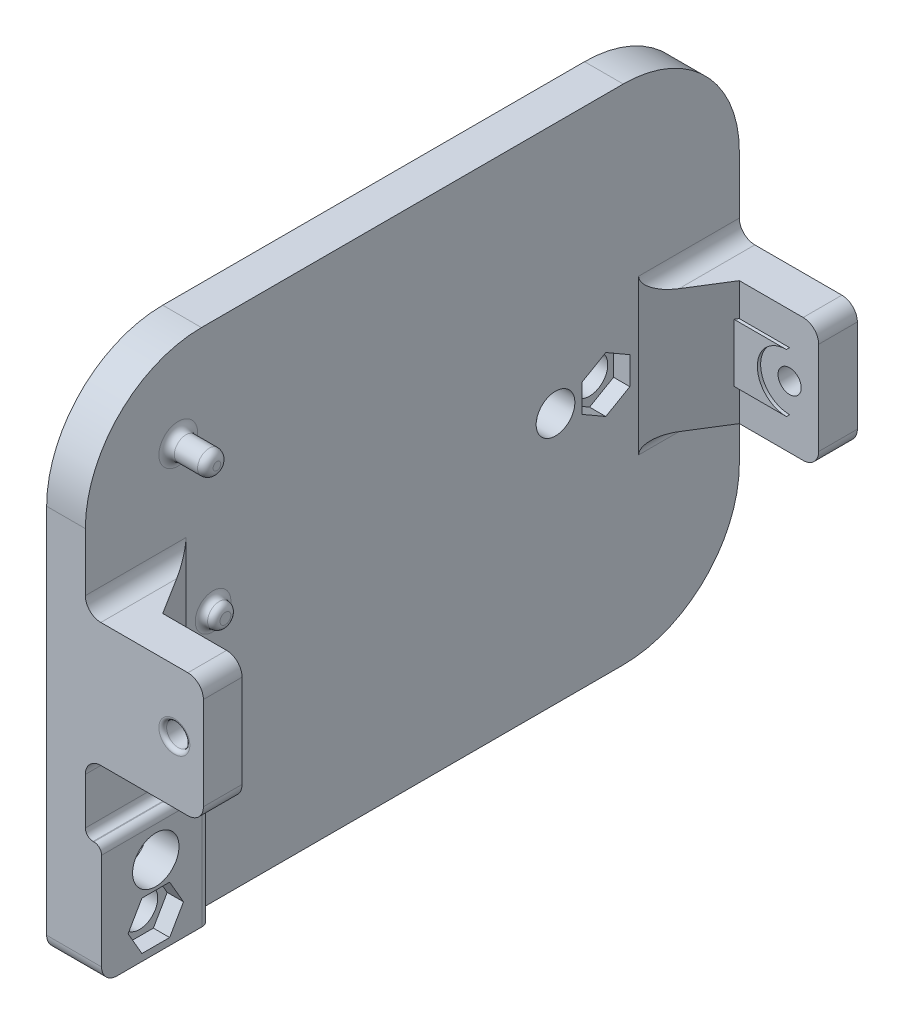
ISO-10303-21;
HEADER;
FILE_DESCRIPTION(('STEP AP214'),'2;1');
FILE_NAME('part.step','',(''),(''),'','','');
FILE_SCHEMA(('AUTOMOTIVE_DESIGN { 1 0 10303 214 1 1 1 1 }'));
ENDSEC;
DATA;
#1=APPLICATION_CONTEXT('core data for automotive mechanical design processes');
#2=APPLICATION_PROTOCOL_DEFINITION('international standard','automotive_design',2000,#1);
#3=PRODUCT_CONTEXT('',#1,'mechanical');
#4=PRODUCT('Part','Part','',(#3));
#5=PRODUCT_RELATED_PRODUCT_CATEGORY('part','',(#4));
#6=PRODUCT_DEFINITION_FORMATION('','',#4);
#7=PRODUCT_DEFINITION_CONTEXT('part definition',#1,'design');
#8=PRODUCT_DEFINITION('design','',#6,#7);
#9=PRODUCT_DEFINITION_SHAPE('','',#8);
#10=(LENGTH_UNIT() NAMED_UNIT(*) SI_UNIT(.MILLI.,.METRE.));
#11=(NAMED_UNIT(*) PLANE_ANGLE_UNIT() SI_UNIT($,.RADIAN.));
#12=(NAMED_UNIT(*) SI_UNIT($,.STERADIAN.) SOLID_ANGLE_UNIT());
#13=UNCERTAINTY_MEASURE_WITH_UNIT(LENGTH_MEASURE(1.E-05),#10,'distance_accuracy_value','');
#14=(GEOMETRIC_REPRESENTATION_CONTEXT(3) GLOBAL_UNCERTAINTY_ASSIGNED_CONTEXT((#13)) GLOBAL_UNIT_ASSIGNED_CONTEXT((#10,
#11,#12)) REPRESENTATION_CONTEXT('',''));
#15=CARTESIAN_POINT('',(0.,0.,0.));
#16=DIRECTION('',(0.,0.,1.));
#17=DIRECTION('',(1.,0.,0.));
#18=AXIS2_PLACEMENT_3D('',#15,#16,#17);
#19=CARTESIAN_POINT('',(20.25,24.5,79.5));
#20=DIRECTION('',(0.,0.,1.));
#21=DIRECTION('',(1.,0.,0.));
#22=AXIS2_PLACEMENT_3D('',#19,#20,#21);
#23=PLANE('',#22);
#24=CARTESIAN_POINT('',(16.5,32.5,79.5));
#25=DIRECTION('',(0.,0.,-1.));
#26=DIRECTION('',(-1.,0.,0.));
#27=AXIS2_PLACEMENT_3D('',#24,#25,#26);
#28=CIRCLE('',#27,1.5);
#29=CARTESIAN_POINT('',(15.,32.5,79.5));
#30=VERTEX_POINT('',#29);
#31=EDGE_CURVE('E724',#30,#30,#28,.T.);
#32=ORIENTED_EDGE('',*,*,#31,.F.);
#33=EDGE_LOOP('',(#32));
#34=FACE_BOUND('',#33,.T.);
#35=DIRECTION('',(-1.,0.,0.));
#36=VECTOR('',#35,1.);
#37=CARTESIAN_POINT('',(9.5,28.75,79.5));
#38=LINE('',#37,#36);
#39=CARTESIAN_POINT('',(16.5,28.75,79.5));
#40=VERTEX_POINT('',#39);
#41=CARTESIAN_POINT('',(10.,28.75,79.5));
#42=VERTEX_POINT('',#41);
#43=EDGE_CURVE('E512',#40,#42,#38,.T.);
#44=ORIENTED_EDGE('',*,*,#43,.F.);
#45=CARTESIAN_POINT('',(16.5,32.5,79.5));
#46=DIRECTION('',(0.,0.,1.));
#47=DIRECTION('',(-1.,0.,0.));
#48=AXIS2_PLACEMENT_3D('',#45,#46,#47);
#49=CIRCLE('',#48,3.75);
#50=CARTESIAN_POINT('',(16.5,36.25,79.5));
#51=VERTEX_POINT('',#50);
#52=EDGE_CURVE('E488',#51,#40,#49,.T.);
#53=ORIENTED_EDGE('',*,*,#52,.F.);
#54=DIRECTION('',(1.,0.,0.));
#55=VECTOR('',#54,1.);
#56=CARTESIAN_POINT('',(9.5,36.25,79.5));
#57=LINE('',#56,#55);
#58=CARTESIAN_POINT('',(10.,36.25,79.5));
#59=VERTEX_POINT('',#58);
#60=EDGE_CURVE('E505',#59,#51,#57,.T.);
#61=ORIENTED_EDGE('',*,*,#60,.F.);
#62=DIRECTION('',(0.,1.,0.));
#63=VECTOR('',#62,1.);
#64=CARTESIAN_POINT('',(10.,40.5,79.5));
#65=LINE('',#64,#63);
#66=CARTESIAN_POINT('',(10.,40.5,79.5));
#67=VERTEX_POINT('',#66);
#68=EDGE_CURVE('E846',#59,#67,#65,.T.);
#69=ORIENTED_EDGE('',*,*,#68,.T.);
#70=DIRECTION('',(-1.,0.,0.));
#71=VECTOR('',#70,1.);
#72=CARTESIAN_POINT('',(20.25,40.5,79.5));
#73=LINE('',#72,#71);
#74=CARTESIAN_POINT('',(18.25,40.5,79.5));
#75=VERTEX_POINT('',#74);
#76=EDGE_CURVE('E739',#75,#67,#73,.T.);
#77=ORIENTED_EDGE('',*,*,#76,.F.);
#78=CARTESIAN_POINT('',(18.25,38.5,79.5));
#79=DIRECTION('',(0.,0.,1.));
#80=DIRECTION('',(1.,0.,0.));
#81=AXIS2_PLACEMENT_3D('',#78,#79,#80);
#82=CIRCLE('',#81,2.);
#83=CARTESIAN_POINT('',(20.25,38.5,79.5));
#84=VERTEX_POINT('',#83);
#85=EDGE_CURVE('E929',#75,#84,#82,.F.);
#86=ORIENTED_EDGE('',*,*,#85,.T.);
#87=DIRECTION('',(0.,1.,0.));
#88=VECTOR('',#87,1.);
#89=CARTESIAN_POINT('',(20.25,24.5,79.5));
#90=LINE('',#89,#88);
#91=CARTESIAN_POINT('',(20.25,26.5,79.5));
#92=VERTEX_POINT('',#91);
#93=EDGE_CURVE('E727',#92,#84,#90,.T.);
#94=ORIENTED_EDGE('',*,*,#93,.F.);
#95=CARTESIAN_POINT('',(18.25,26.5,79.5));
#96=DIRECTION('',(0.,0.,1.));
#97=DIRECTION('',(1.,0.,0.));
#98=AXIS2_PLACEMENT_3D('',#95,#96,#97);
#99=CIRCLE('',#98,2.);
#100=CARTESIAN_POINT('',(18.25,24.5,79.5));
#101=VERTEX_POINT('',#100);
#102=EDGE_CURVE('E927',#92,#101,#99,.F.);
#103=ORIENTED_EDGE('',*,*,#102,.T.);
#104=DIRECTION('',(-1.,0.,0.));
#105=VECTOR('',#104,1.);
#106=CARTESIAN_POINT('',(20.25,24.5,79.5));
#107=LINE('',#106,#105);
#108=CARTESIAN_POINT('',(10.,24.5,79.5));
#109=VERTEX_POINT('',#108);
#110=EDGE_CURVE('E742',#101,#109,#107,.T.);
#111=ORIENTED_EDGE('',*,*,#110,.T.);
#112=EDGE_CURVE('E847',#109,#42,#65,.T.);
#113=ORIENTED_EDGE('',*,*,#112,.T.);
#114=EDGE_LOOP('',(#44,#53,#61,#69,#77,#86,#94,#103,#111,#113));
#115=FACE_BOUND('',#114,.T.);
#116=ADVANCED_FACE('F41',(#34,#115),#23,.F.);
#117=CARTESIAN_POINT('',(10.,24.5,79.5));
#118=DIRECTION('',(0.847998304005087,0.,-0.529998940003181));
#119=DIRECTION('',(0.,-1.,0.));
#120=AXIS2_PLACEMENT_3D('',#117,#118,#119);
#121=PLANE('',#120);
#122=DIRECTION('',(0.529998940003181,0.,0.847998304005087));
#123=VECTOR('',#122,1.);
#124=CARTESIAN_POINT('',(10.,28.75,79.5));
#125=LINE('',#124,#123);
#126=CARTESIAN_POINT('',(9.7375,28.75,79.08));
#127=VERTEX_POINT('',#126);
#128=EDGE_CURVE('E1038',#42,#127,#125,.F.);
#129=ORIENTED_EDGE('',*,*,#128,.F.);
#130=ORIENTED_EDGE('',*,*,#112,.F.);
#131=DIRECTION('',(-0.529998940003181,0.,-0.847998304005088));
#132=VECTOR('',#131,1.);
#133=CARTESIAN_POINT('',(15.126404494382,24.5,87.7022471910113));
#134=LINE('',#133,#132);
#135=CARTESIAN_POINT('',(7.,24.5,74.7));
#136=VERTEX_POINT('',#135);
#137=EDGE_CURVE('E855',#136,#109,#134,.F.);
#138=ORIENTED_EDGE('',*,*,#137,.F.);
#139=CARTESIAN_POINT('',(7.,22.5,74.7));
#140=DIRECTION('',(0.847998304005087,0.,-0.529998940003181));
#141=DIRECTION('',(0.529998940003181,0.,0.847998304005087));
#142=AXIS2_PLACEMENT_3D('',#139,#140,#141);
#143=ELLIPSE('',#142,3.77359245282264,2.);
#144=CARTESIAN_POINT('',(5.,22.5,71.5));
#145=VERTEX_POINT('',#144);
#146=EDGE_CURVE('E956',#136,#145,#143,.F.);
#147=ORIENTED_EDGE('',*,*,#146,.T.);
#148=DIRECTION('',(0.,-1.,0.));
#149=VECTOR('',#148,1.);
#150=CARTESIAN_POINT('',(5.,24.5,71.5));
#151=LINE('',#150,#149);
#152=CARTESIAN_POINT('',(5.,42.5,71.5));
#153=VERTEX_POINT('',#152);
#154=EDGE_CURVE('E850',#153,#145,#151,.T.);
#155=ORIENTED_EDGE('',*,*,#154,.F.);
#156=CARTESIAN_POINT('',(7.,42.5,74.7));
#157=DIRECTION('',(0.847998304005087,0.,-0.529998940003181));
#158=DIRECTION('',(-0.529998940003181,0.,-0.847998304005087));
#159=AXIS2_PLACEMENT_3D('',#156,#157,#158);
#160=ELLIPSE('',#159,3.77359245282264,2.);
#161=CARTESIAN_POINT('',(7.,40.5,74.7));
#162=VERTEX_POINT('',#161);
#163=EDGE_CURVE('E963',#153,#162,#160,.F.);
#164=ORIENTED_EDGE('',*,*,#163,.T.);
#165=DIRECTION('',(0.529998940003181,0.,0.847998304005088));
#166=VECTOR('',#165,1.);
#167=CARTESIAN_POINT('',(15.126404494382,40.5,87.7022471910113));
#168=LINE('',#167,#166);
#169=EDGE_CURVE('E852',#67,#162,#168,.F.);
#170=ORIENTED_EDGE('',*,*,#169,.F.);
#171=ORIENTED_EDGE('',*,*,#68,.F.);
#172=DIRECTION('',(-0.529998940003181,0.,-0.847998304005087));
#173=VECTOR('',#172,1.);
#174=CARTESIAN_POINT('',(10.,36.25,79.5));
#175=LINE('',#174,#173);
#176=CARTESIAN_POINT('',(9.7375,36.25,79.08));
#177=VERTEX_POINT('',#176);
#178=EDGE_CURVE('E1036',#177,#59,#175,.F.);
#179=ORIENTED_EDGE('',*,*,#178,.F.);
#180=DIRECTION('',(0.,1.,0.));
#181=VECTOR('',#180,1.);
#182=CARTESIAN_POINT('',(9.7375,24.5,79.08));
#183=LINE('',#182,#181);
#184=EDGE_CURVE('E1031',#177,#127,#183,.F.);
#185=ORIENTED_EDGE('',*,*,#184,.T.);
#186=EDGE_LOOP('',(#129,#130,#138,#147,#155,#164,#170,#171,#179,#185));
#187=FACE_BOUND('',#186,.T.);
#188=ADVANCED_FACE('F1103',(#187),#121,.T.);
#189=CARTESIAN_POINT('',(5.,32.5,17.25));
#190=DIRECTION('',(-1.,0.,0.));
#191=DIRECTION('',(0.,0.,1.));
#192=AXIS2_PLACEMENT_3D('',#189,#190,#191);
#193=CYLINDRICAL_SURFACE('',#192,2.35);
#194=CARTESIAN_POINT('',(0.,32.5,17.25));
#195=DIRECTION('',(1.,0.,0.));
#196=DIRECTION('',(0.,0.,-1.));
#197=AXIS2_PLACEMENT_3D('',#194,#195,#196);
#198=CIRCLE('',#197,2.35);
#199=CARTESIAN_POINT('',(0.,32.5,14.9));
#200=VERTEX_POINT('',#199);
#201=EDGE_CURVE('E745',#200,#200,#198,.T.);
#202=ORIENTED_EDGE('',*,*,#201,.F.);
#203=EDGE_LOOP('',(#202));
#204=FACE_BOUND('',#203,.T.);
#205=CARTESIAN_POINT('',(2.9,32.5,17.25));
#206=DIRECTION('',(1.,0.,0.));
#207=DIRECTION('',(0.,0.,-1.));
#208=AXIS2_PLACEMENT_3D('',#205,#206,#207);
#209=CIRCLE('',#208,2.35);
#210=CARTESIAN_POINT('',(2.9,32.5,14.9));
#211=VERTEX_POINT('',#210);
#212=EDGE_CURVE('E559',#211,#211,#209,.T.);
#213=ORIENTED_EDGE('',*,*,#212,.T.);
#214=EDGE_LOOP('',(#213));
#215=FACE_BOUND('',#214,.T.);
#216=ADVANCED_FACE('F1162',(#204,#215),#193,.F.);
#217=CARTESIAN_POINT('',(5.,4.,77.5));
#218=DIRECTION('',(-1.,0.,0.));
#219=DIRECTION('',(0.,0.,1.));
#220=AXIS2_PLACEMENT_3D('',#217,#218,#219);
#221=CYLINDRICAL_SURFACE('',#220,2.35);
#222=CARTESIAN_POINT('',(0.,4.,77.5));
#223=DIRECTION('',(1.,0.,0.));
#224=DIRECTION('',(0.,0.,-1.));
#225=AXIS2_PLACEMENT_3D('',#222,#223,#224);
#226=CIRCLE('',#225,2.35);
#227=CARTESIAN_POINT('',(0.,4.,75.15));
#228=VERTEX_POINT('',#227);
#229=EDGE_CURVE('E755',#228,#228,#226,.T.);
#230=ORIENTED_EDGE('',*,*,#229,.F.);
#231=EDGE_LOOP('',(#230));
#232=FACE_BOUND('',#231,.T.);
#233=CARTESIAN_POINT('',(5.,4.,77.5));
#234=DIRECTION('',(1.,0.,0.));
#235=DIRECTION('',(0.,0.,-1.));
#236=AXIS2_PLACEMENT_3D('',#233,#234,#235);
#237=CIRCLE('',#236,2.35);
#238=CARTESIAN_POINT('',(5.,4.,75.15));
#239=VERTEX_POINT('',#238);
#240=EDGE_CURVE('E608',#239,#239,#237,.T.);
#241=ORIENTED_EDGE('',*,*,#240,.T.);
#242=EDGE_LOOP('',(#241));
#243=FACE_BOUND('',#242,.T.);
#244=ADVANCED_FACE('F1173',(#232,#243),#221,.F.);
#245=CARTESIAN_POINT('',(5.,0.,0.));
#246=DIRECTION('',(-1.,0.,0.));
#247=DIRECTION('',(0.,0.,1.));
#248=AXIS2_PLACEMENT_3D('',#245,#246,#247);
#249=PLANE('',#248);
#250=CARTESIAN_POINT('',(5.,32.5,68.));
#251=DIRECTION('',(-1.,0.,0.));
#252=DIRECTION('',(0.,0.,1.));
#253=AXIS2_PLACEMENT_3D('',#250,#251,#252);
#254=CIRCLE('',#253,2.3);
#255=CARTESIAN_POINT('',(5.,32.5,70.3));
#256=VERTEX_POINT('',#255);
#257=EDGE_CURVE('E1028',#256,#256,#254,.T.);
#258=ORIENTED_EDGE('',*,*,#257,.T.);
#259=EDGE_LOOP('',(#258));
#260=FACE_BOUND('',#259,.T.);
#261=CARTESIAN_POINT('',(5.,53.5,72.5));
#262=DIRECTION('',(-1.,0.,0.));
#263=DIRECTION('',(0.,0.,1.));
#264=AXIS2_PLACEMENT_3D('',#261,#262,#263);
#265=CIRCLE('',#264,2.5);
#266=CARTESIAN_POINT('',(5.,53.5,75.));
#267=VERTEX_POINT('',#266);
#268=EDGE_CURVE('E981',#267,#267,#265,.T.);
#269=ORIENTED_EDGE('',*,*,#268,.T.);
#270=EDGE_LOOP('',(#269));
#271=FACE_BOUND('',#270,.T.);
#272=DIRECTION('',(0.,0.499999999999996,0.866025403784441));
#273=VECTOR('',#272,1.);
#274=CARTESIAN_POINT('',(5.,34.2897858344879,14.15));
#275=LINE('',#274,#273);
#276=CARTESIAN_POINT('',(5.,34.2897858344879,14.15));
#277=VERTEX_POINT('',#276);
#278=CARTESIAN_POINT('',(5.,36.0795716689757,17.25));
#279=VERTEX_POINT('',#278);
#280=EDGE_CURVE('E542',#277,#279,#275,.T.);
#281=ORIENTED_EDGE('',*,*,#280,.F.);
#282=DIRECTION('',(0.,1.,0.));
#283=VECTOR('',#282,1.);
#284=CARTESIAN_POINT('',(5.,30.7102141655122,14.15));
#285=LINE('',#284,#283);
#286=CARTESIAN_POINT('',(5.,30.7102141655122,14.15));
#287=VERTEX_POINT('',#286);
#288=EDGE_CURVE('E540',#287,#277,#285,.T.);
#289=ORIENTED_EDGE('',*,*,#288,.F.);
#290=DIRECTION('',(0.,0.500000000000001,-0.866025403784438));
#291=VECTOR('',#290,1.);
#292=CARTESIAN_POINT('',(5.,28.9204283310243,17.25));
#293=LINE('',#292,#291);
#294=CARTESIAN_POINT('',(5.,28.9204283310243,17.25));
#295=VERTEX_POINT('',#294);
#296=EDGE_CURVE('E524',#295,#287,#293,.T.);
#297=ORIENTED_EDGE('',*,*,#296,.F.);
#298=DIRECTION('',(0.,-0.499999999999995,-0.866025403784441));
#299=VECTOR('',#298,1.);
#300=CARTESIAN_POINT('',(5.,30.7102141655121,20.35));
#301=LINE('',#300,#299);
#302=CARTESIAN_POINT('',(5.,30.7102141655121,20.35));
#303=VERTEX_POINT('',#302);
#304=EDGE_CURVE('E552',#303,#295,#301,.T.);
#305=ORIENTED_EDGE('',*,*,#304,.F.);
#306=DIRECTION('',(0.,-1.,0.));
#307=VECTOR('',#306,1.);
#308=CARTESIAN_POINT('',(5.,34.2897858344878,20.35));
#309=LINE('',#308,#307);
#310=CARTESIAN_POINT('',(5.,34.2897858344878,20.35));
#311=VERTEX_POINT('',#310);
#312=EDGE_CURVE('E549',#311,#303,#309,.T.);
#313=ORIENTED_EDGE('',*,*,#312,.F.);
#314=DIRECTION('',(0.,-0.500000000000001,0.866025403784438));
#315=VECTOR('',#314,1.);
#316=CARTESIAN_POINT('',(5.,36.0795716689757,17.25));
#317=LINE('',#316,#315);
#318=EDGE_CURVE('E546',#279,#311,#317,.T.);
#319=ORIENTED_EDGE('',*,*,#318,.F.);
#320=EDGE_LOOP('',(#281,#289,#297,#305,#313,#319));
#321=FACE_BOUND('',#320,.T.);
#322=CARTESIAN_POINT('',(5.,32.5,23.75));
#323=DIRECTION('',(1.,0.,0.));
#324=DIRECTION('',(0.,0.,-1.));
#325=AXIS2_PLACEMENT_3D('',#322,#323,#324);
#326=CIRCLE('',#325,2.5);
#327=CARTESIAN_POINT('',(5.,32.5,21.25));
#328=VERTEX_POINT('',#327);
#329=EDGE_CURVE('E752',#328,#328,#326,.T.);
#330=ORIENTED_EDGE('',*,*,#329,.F.);
#331=EDGE_LOOP('',(#330));
#332=FACE_BOUND('',#331,.T.);
#333=DIRECTION('',(0.,-1.,0.));
#334=VECTOR('',#333,1.);
#335=CARTESIAN_POINT('',(5.,0.,84.5));
#336=LINE('',#335,#334);
#337=CARTESIAN_POINT('',(5.,22.5,84.5));
#338=VERTEX_POINT('',#337);
#339=CARTESIAN_POINT('',(5.,16.5,84.5));
#340=VERTEX_POINT('',#339);
#341=EDGE_CURVE('E773',#338,#340,#336,.T.);
#342=ORIENTED_EDGE('',*,*,#341,.T.);
#343=DIRECTION('',(0.,0.,1.));
#344=VECTOR('',#343,1.);
#345=CARTESIAN_POINT('',(5.,16.5,70.5));
#346=LINE('',#345,#344);
#347=CARTESIAN_POINT('',(5.,16.5,71.5));
#348=VERTEX_POINT('',#347);
#349=EDGE_CURVE('E979',#340,#348,#346,.F.);
#350=ORIENTED_EDGE('',*,*,#349,.T.);
#351=CARTESIAN_POINT('',(5.,14.5,71.5));
#352=DIRECTION('',(-1.,0.,0.));
#353=DIRECTION('',(0.,0.,1.));
#354=AXIS2_PLACEMENT_3D('',#351,#352,#353);
#355=CIRCLE('',#354,2.);
#356=CARTESIAN_POINT('',(5.,14.5,69.5));
#357=VERTEX_POINT('',#356);
#358=EDGE_CURVE('E976',#357,#348,#355,.F.);
#359=ORIENTED_EDGE('',*,*,#358,.F.);
#360=DIRECTION('',(0.,1.,0.));
#361=VECTOR('',#360,1.);
#362=CARTESIAN_POINT('',(5.,0.,69.5));
#363=LINE('',#362,#361);
#364=CARTESIAN_POINT('',(5.,0.,69.5));
#365=VERTEX_POINT('',#364);
#366=EDGE_CURVE('E974',#357,#365,#363,.F.);
#367=ORIENTED_EDGE('',*,*,#366,.T.);
#368=DIRECTION('',(0.,0.,-1.));
#369=VECTOR('',#368,1.);
#370=CARTESIAN_POINT('',(5.,0.,0.));
#371=LINE('',#370,#369);
#372=CARTESIAN_POINT('',(5.,0.,15.));
#373=VERTEX_POINT('',#372);
#374=EDGE_CURVE('E763',#365,#373,#371,.T.);
#375=ORIENTED_EDGE('',*,*,#374,.T.);
#376=CARTESIAN_POINT('',(5.,15.,15.));
#377=DIRECTION('',(-1.,0.,0.));
#378=DIRECTION('',(0.,0.,1.));
#379=AXIS2_PLACEMENT_3D('',#376,#377,#378);
#380=CIRCLE('',#379,15.);
#381=CARTESIAN_POINT('',(5.,15.,0.));
#382=VERTEX_POINT('',#381);
#383=EDGE_CURVE('E836',#373,#382,#380,.F.);
#384=ORIENTED_EDGE('',*,*,#383,.T.);
#385=DIRECTION('',(0.,1.,0.));
#386=VECTOR('',#385,1.);
#387=CARTESIAN_POINT('',(5.,0.,0.));
#388=LINE('',#387,#386);
#389=CARTESIAN_POINT('',(5.,22.5,0.));
#390=VERTEX_POINT('',#389);
#391=EDGE_CURVE('E767',#382,#390,#388,.T.);
#392=ORIENTED_EDGE('',*,*,#391,.T.);
#393=DIRECTION('',(0.,0.,1.));
#394=VECTOR('',#393,1.);
#395=CARTESIAN_POINT('',(5.,22.5,0.));
#396=LINE('',#395,#394);
#397=CARTESIAN_POINT('',(5.,22.5,12.9999999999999));
#398=VERTEX_POINT('',#397);
#399=EDGE_CURVE('E941',#390,#398,#396,.T.);
#400=ORIENTED_EDGE('',*,*,#399,.T.);
#401=DIRECTION('',(0.,1.,0.));
#402=VECTOR('',#401,1.);
#403=CARTESIAN_POINT('',(5.,0.,12.9999999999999));
#404=LINE('',#403,#402);
#405=CARTESIAN_POINT('',(5.,42.5,12.9999999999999));
#406=VERTEX_POINT('',#405);
#407=EDGE_CURVE('E857',#398,#406,#404,.T.);
#408=ORIENTED_EDGE('',*,*,#407,.T.);
#409=DIRECTION('',(0.,0.,-1.));
#410=VECTOR('',#409,1.);
#411=CARTESIAN_POINT('',(5.,42.5,0.));
#412=LINE('',#411,#410);
#413=CARTESIAN_POINT('',(5.,42.5,0.));
#414=VERTEX_POINT('',#413);
#415=EDGE_CURVE('E944',#406,#414,#412,.T.);
#416=ORIENTED_EDGE('',*,*,#415,.T.);
#417=CARTESIAN_POINT('',(5.,50.,0.));
#418=VERTEX_POINT('',#417);
#419=EDGE_CURVE('E765',#414,#418,#388,.T.);
#420=ORIENTED_EDGE('',*,*,#419,.T.);
#421=CARTESIAN_POINT('',(5.,50.,15.));
#422=DIRECTION('',(-1.,0.,0.));
#423=DIRECTION('',(0.,0.,1.));
#424=AXIS2_PLACEMENT_3D('',#421,#422,#423);
#425=CIRCLE('',#424,15.);
#426=CARTESIAN_POINT('',(5.,65.,15.));
#427=VERTEX_POINT('',#426);
#428=EDGE_CURVE('E838',#418,#427,#425,.F.);
#429=ORIENTED_EDGE('',*,*,#428,.T.);
#430=DIRECTION('',(0.,0.,1.));
#431=VECTOR('',#430,1.);
#432=CARTESIAN_POINT('',(5.,65.,0.));
#433=LINE('',#432,#431);
#434=CARTESIAN_POINT('',(5.,65.,69.5));
#435=VERTEX_POINT('',#434);
#436=EDGE_CURVE('E770',#427,#435,#433,.T.);
#437=ORIENTED_EDGE('',*,*,#436,.T.);
#438=CARTESIAN_POINT('',(5.,50.,69.5));
#439=DIRECTION('',(-1.,0.,0.));
#440=DIRECTION('',(0.,0.,1.));
#441=AXIS2_PLACEMENT_3D('',#438,#439,#440);
#442=CIRCLE('',#441,15.);
#443=CARTESIAN_POINT('',(5.,50.,84.5));
#444=VERTEX_POINT('',#443);
#445=EDGE_CURVE('E834',#435,#444,#442,.F.);
#446=ORIENTED_EDGE('',*,*,#445,.T.);
#447=CARTESIAN_POINT('',(5.,42.5,84.5));
#448=VERTEX_POINT('',#447);
#449=EDGE_CURVE('E774',#444,#448,#336,.T.);
#450=ORIENTED_EDGE('',*,*,#449,.T.);
#451=DIRECTION('',(0.,0.,1.));
#452=VECTOR('',#451,1.);
#453=CARTESIAN_POINT('',(5.,42.5,71.5));
#454=LINE('',#453,#452);
#455=EDGE_CURVE('E936',#448,#153,#454,.F.);
#456=ORIENTED_EDGE('',*,*,#455,.T.);
#457=ORIENTED_EDGE('',*,*,#154,.T.);
#458=DIRECTION('',(0.,0.,-1.));
#459=VECTOR('',#458,1.);
#460=CARTESIAN_POINT('',(5.,22.5,84.5));
#461=LINE('',#460,#459);
#462=EDGE_CURVE('E939',#145,#338,#461,.F.);
#463=ORIENTED_EDGE('',*,*,#462,.T.);
#464=EDGE_LOOP('',(#342,#350,#359,#367,#375,#384,#392,#400,#408,#416,#420,#429,#437,#446,#450,
#456,#457,#463));
#465=FACE_BOUND('',#464,.T.);
#466=ADVANCED_FACE('F1065',(#260,#271,#321,#332,#465),#249,.F.);
#467=CARTESIAN_POINT('',(0.,0.,0.));
#468=DIRECTION('',(-1.,0.,0.));
#469=DIRECTION('',(0.,0.,1.));
#470=AXIS2_PLACEMENT_3D('',#467,#468,#469);
#471=PLANE('',#470);
#472=DIRECTION('',(0.,-0.707106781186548,-0.707106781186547));
#473=VECTOR('',#472,1.);
#474=CARTESIAN_POINT('',(0.,7.24730880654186,73.398780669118));
#475=LINE('',#474,#473);
#476=CARTESIAN_POINT('',(0.,14.601219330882,80.7526911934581));
#477=VERTEX_POINT('',#476);
#478=CARTESIAN_POINT('',(0.,13.0027250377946,79.1541969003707));
#479=VERTEX_POINT('',#478);
#480=EDGE_CURVE('E648',#477,#479,#475,.T.);
#481=ORIENTED_EDGE('',*,*,#480,.F.);
#482=DIRECTION('',(0.,0.70710678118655,-0.707106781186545));
#483=VECTOR('',#482,1.);
#484=CARTESIAN_POINT('',(0.,14.601219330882,80.7526911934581));
#485=LINE('',#484,#483);
#486=CARTESIAN_POINT('',(0.,13.7526911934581,81.601219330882));
#487=VERTEX_POINT('',#486);
#488=EDGE_CURVE('E657',#487,#477,#485,.T.);
#489=ORIENTED_EDGE('',*,*,#488,.F.);
#490=DIRECTION('',(0.,0.707106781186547,0.707106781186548));
#491=VECTOR('',#490,1.);
#492=CARTESIAN_POINT('',(0.,13.7526911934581,81.601219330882));
#493=LINE('',#492,#491);
#494=CARTESIAN_POINT('',(0.,12.1541969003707,80.0027250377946));
#495=VERTEX_POINT('',#494);
#496=EDGE_CURVE('E654',#495,#487,#493,.T.);
#497=ORIENTED_EDGE('',*,*,#496,.F.);
#498=CARTESIAN_POINT('',(0.,10.5,77.5));
#499=DIRECTION('',(1.,0.,0.));
#500=DIRECTION('',(0.,0.,-1.));
#501=AXIS2_PLACEMENT_3D('',#498,#499,#500);
#502=CIRCLE('',#501,3.);
#503=CARTESIAN_POINT('',(0.,7.99727496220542,75.8458030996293));
#504=VERTEX_POINT('',#503);
#505=EDGE_CURVE('E751',#495,#504,#502,.T.);
#506=ORIENTED_EDGE('',*,*,#505,.T.);
#507=CARTESIAN_POINT('',(0.,6.39878066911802,74.2473088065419));
#508=VERTEX_POINT('',#507);
#509=EDGE_CURVE('E655',#508,#504,#493,.T.);
#510=ORIENTED_EDGE('',*,*,#509,.F.);
#511=DIRECTION('',(0.,-0.707106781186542,0.707106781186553));
#512=VECTOR('',#511,1.);
#513=CARTESIAN_POINT('',(0.,6.39878066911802,74.2473088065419));
#514=LINE('',#513,#512);
#515=CARTESIAN_POINT('',(0.,7.24730880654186,73.398780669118));
#516=VERTEX_POINT('',#515);
#517=EDGE_CURVE('E650',#516,#508,#514,.T.);
#518=ORIENTED_EDGE('',*,*,#517,.F.);
#519=CARTESIAN_POINT('',(0.,8.84580309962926,74.9972749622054));
#520=VERTEX_POINT('',#519);
#521=EDGE_CURVE('E651',#520,#516,#475,.T.);
#522=ORIENTED_EDGE('',*,*,#521,.F.);
#523=EDGE_CURVE('E748',#520,#479,#502,.T.);
#524=ORIENTED_EDGE('',*,*,#523,.T.);
#525=EDGE_LOOP('',(#481,#489,#497,#506,#510,#518,#522,#524));
#526=FACE_BOUND('',#525,.T.);
#527=DIRECTION('',(0.,1.,0.));
#528=VECTOR('',#527,1.);
#529=CARTESIAN_POINT('',(0.,27.3,24.35));
#530=LINE('',#529,#528);
#531=CARTESIAN_POINT('',(0.,34.9269322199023,24.35));
#532=VERTEX_POINT('',#531);
#533=CARTESIAN_POINT('',(0.,37.7,24.35));
#534=VERTEX_POINT('',#533);
#535=EDGE_CURVE('E684',#532,#534,#530,.T.);
#536=ORIENTED_EDGE('',*,*,#535,.F.);
#537=CARTESIAN_POINT('',(0.,32.5,23.75));
#538=DIRECTION('',(1.,0.,0.));
#539=DIRECTION('',(0.,0.,-1.));
#540=AXIS2_PLACEMENT_3D('',#537,#538,#539);
#541=CIRCLE('',#540,2.5);
#542=CARTESIAN_POINT('',(0.,30.0730677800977,24.35));
#543=VERTEX_POINT('',#542);
#544=EDGE_CURVE('E756',#532,#543,#541,.T.);
#545=ORIENTED_EDGE('',*,*,#544,.T.);
#546=CARTESIAN_POINT('',(0.,27.3,24.35));
#547=VERTEX_POINT('',#546);
#548=EDGE_CURVE('E681',#547,#543,#530,.T.);
#549=ORIENTED_EDGE('',*,*,#548,.F.);
#550=DIRECTION('',(0.,0.,1.));
#551=VECTOR('',#550,1.);
#552=CARTESIAN_POINT('',(0.,27.3,23.15));
#553=LINE('',#552,#551);
#554=CARTESIAN_POINT('',(0.,27.3,23.15));
#555=VERTEX_POINT('',#554);
#556=EDGE_CURVE('E683',#555,#547,#553,.T.);
#557=ORIENTED_EDGE('',*,*,#556,.F.);
#558=DIRECTION('',(0.,-1.,0.));
#559=VECTOR('',#558,1.);
#560=CARTESIAN_POINT('',(0.,37.7,23.15));
#561=LINE('',#560,#559);
#562=CARTESIAN_POINT('',(0.,30.0730677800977,23.15));
#563=VERTEX_POINT('',#562);
#564=EDGE_CURVE('E687',#563,#555,#561,.T.);
#565=ORIENTED_EDGE('',*,*,#564,.F.);
#566=CARTESIAN_POINT('',(0.,34.9269322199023,23.15));
#567=VERTEX_POINT('',#566);
#568=EDGE_CURVE('E757',#563,#567,#541,.T.);
#569=ORIENTED_EDGE('',*,*,#568,.T.);
#570=CARTESIAN_POINT('',(0.,37.7,23.15));
#571=VERTEX_POINT('',#570);
#572=EDGE_CURVE('E688',#571,#567,#561,.T.);
#573=ORIENTED_EDGE('',*,*,#572,.F.);
#574=DIRECTION('',(0.,0.,-1.));
#575=VECTOR('',#574,1.);
#576=CARTESIAN_POINT('',(0.,37.7,24.35));
#577=LINE('',#576,#575);
#578=EDGE_CURVE('E690',#534,#571,#577,.T.);
#579=ORIENTED_EDGE('',*,*,#578,.F.);
#580=EDGE_LOOP('',(#536,#545,#549,#557,#565,#569,#573,#579));
#581=FACE_BOUND('',#580,.T.);
#582=ORIENTED_EDGE('',*,*,#229,.T.);
#583=EDGE_LOOP('',(#582));
#584=FACE_BOUND('',#583,.T.);
#585=DIRECTION('',(0.,0.,-1.));
#586=VECTOR('',#585,1.);
#587=CARTESIAN_POINT('',(0.,0.,0.));
#588=LINE('',#587,#586);
#589=CARTESIAN_POINT('',(0.,0.,82.5));
#590=VERTEX_POINT('',#589);
#591=CARTESIAN_POINT('',(0.,0.,15.));
#592=VERTEX_POINT('',#591);
#593=EDGE_CURVE('E762',#590,#592,#588,.T.);
#594=ORIENTED_EDGE('',*,*,#593,.F.);
#595=CARTESIAN_POINT('',(0.,2.,82.5));
#596=DIRECTION('',(-1.,0.,0.));
#597=DIRECTION('',(0.,0.,1.));
#598=AXIS2_PLACEMENT_3D('',#595,#596,#597);
#599=CIRCLE('',#598,2.);
#600=CARTESIAN_POINT('',(0.,2.,84.5));
#601=VERTEX_POINT('',#600);
#602=EDGE_CURVE('E883',#590,#601,#599,.T.);
#603=ORIENTED_EDGE('',*,*,#602,.T.);
#604=DIRECTION('',(0.,-1.,0.));
#605=VECTOR('',#604,1.);
#606=CARTESIAN_POINT('',(0.,0.,84.5));
#607=LINE('',#606,#605);
#608=CARTESIAN_POINT('',(0.,50.,84.5));
#609=VERTEX_POINT('',#608);
#610=EDGE_CURVE('E766',#609,#601,#607,.T.);
#611=ORIENTED_EDGE('',*,*,#610,.F.);
#612=CARTESIAN_POINT('',(0.,50.,69.5));
#613=DIRECTION('',(-1.,0.,0.));
#614=DIRECTION('',(0.,0.,1.));
#615=AXIS2_PLACEMENT_3D('',#612,#613,#614);
#616=CIRCLE('',#615,15.);
#617=CARTESIAN_POINT('',(0.,65.,69.5));
#618=VERTEX_POINT('',#617);
#619=EDGE_CURVE('E821',#609,#618,#616,.T.);
#620=ORIENTED_EDGE('',*,*,#619,.T.);
#621=DIRECTION('',(0.,0.,1.));
#622=VECTOR('',#621,1.);
#623=CARTESIAN_POINT('',(0.,65.,0.));
#624=LINE('',#623,#622);
#625=CARTESIAN_POINT('',(0.,65.,15.));
#626=VERTEX_POINT('',#625);
#627=EDGE_CURVE('E782',#626,#618,#624,.T.);
#628=ORIENTED_EDGE('',*,*,#627,.F.);
#629=CARTESIAN_POINT('',(0.,50.,15.));
#630=DIRECTION('',(-1.,0.,0.));
#631=DIRECTION('',(0.,0.,1.));
#632=AXIS2_PLACEMENT_3D('',#629,#630,#631);
#633=CIRCLE('',#632,15.);
#634=CARTESIAN_POINT('',(0.,50.,0.));
#635=VERTEX_POINT('',#634);
#636=EDGE_CURVE('E826',#626,#635,#633,.T.);
#637=ORIENTED_EDGE('',*,*,#636,.T.);
#638=DIRECTION('',(0.,1.,0.));
#639=VECTOR('',#638,1.);
#640=CARTESIAN_POINT('',(0.,0.,0.));
#641=LINE('',#640,#639);
#642=CARTESIAN_POINT('',(0.,15.,0.));
#643=VERTEX_POINT('',#642);
#644=EDGE_CURVE('E779',#643,#635,#641,.T.);
#645=ORIENTED_EDGE('',*,*,#644,.F.);
#646=CARTESIAN_POINT('',(0.,15.,15.));
#647=DIRECTION('',(-1.,0.,0.));
#648=DIRECTION('',(0.,0.,1.));
#649=AXIS2_PLACEMENT_3D('',#646,#647,#648);
#650=CIRCLE('',#649,15.);
#651=EDGE_CURVE('E823',#643,#592,#650,.T.);
#652=ORIENTED_EDGE('',*,*,#651,.T.);
#653=EDGE_LOOP('',(#594,#603,#611,#620,#628,#637,#645,#652));
#654=FACE_BOUND('',#653,.T.);
#655=ORIENTED_EDGE('',*,*,#201,.T.);
#656=EDGE_LOOP('',(#655));
#657=FACE_BOUND('',#656,.T.);
#658=ADVANCED_FACE('F1187',(#526,#581,#584,#654,#657),#471,.T.);
#659=CARTESIAN_POINT('',(5.,0.,0.));
#660=DIRECTION('',(0.,1.,0.));
#661=DIRECTION('',(0.,0.,1.));
#662=AXIS2_PLACEMENT_3D('',#659,#660,#661);
#663=PLANE('',#662);
#664=DIRECTION('',(-1.,0.,0.));
#665=VECTOR('',#664,1.);
#666=CARTESIAN_POINT('',(7.1,0.,70.5));
#667=LINE('',#666,#665);
#668=CARTESIAN_POINT('',(6.1,0.,70.5));
#669=VERTEX_POINT('',#668);
#670=CARTESIAN_POINT('',(6.,0.,70.5));
#671=VERTEX_POINT('',#670);
#672=EDGE_CURVE('E644',#669,#671,#667,.T.);
#673=ORIENTED_EDGE('',*,*,#672,.F.);
#674=CARTESIAN_POINT('',(6.1,0.,71.5));
#675=DIRECTION('',(0.,1.,0.));
#676=DIRECTION('',(0.,0.,1.));
#677=AXIS2_PLACEMENT_3D('',#674,#675,#676);
#678=CIRCLE('',#677,1.);
#679=CARTESIAN_POINT('',(7.1,0.,71.5));
#680=VERTEX_POINT('',#679);
#681=EDGE_CURVE('E1003',#669,#680,#678,.F.);
#682=ORIENTED_EDGE('',*,*,#681,.T.);
#683=DIRECTION('',(0.,0.,-1.));
#684=VECTOR('',#683,1.);
#685=CARTESIAN_POINT('',(7.1,0.,84.5));
#686=LINE('',#685,#684);
#687=CARTESIAN_POINT('',(7.1,0.,82.5));
#688=VERTEX_POINT('',#687);
#689=EDGE_CURVE('E636',#688,#680,#686,.T.);
#690=ORIENTED_EDGE('',*,*,#689,.F.);
#691=DIRECTION('',(-1.,0.,0.));
#692=VECTOR('',#691,1.);
#693=CARTESIAN_POINT('',(5.,0.,82.5));
#694=LINE('',#693,#692);
#695=EDGE_CURVE('E880',#688,#590,#694,.T.);
#696=ORIENTED_EDGE('',*,*,#695,.T.);
#697=ORIENTED_EDGE('',*,*,#593,.T.);
#698=DIRECTION('',(-1.,0.,0.));
#699=VECTOR('',#698,1.);
#700=CARTESIAN_POINT('',(5.,0.,15.));
#701=LINE('',#700,#699);
#702=EDGE_CURVE('E840',#592,#373,#701,.F.);
#703=ORIENTED_EDGE('',*,*,#702,.T.);
#704=ORIENTED_EDGE('',*,*,#374,.F.);
#705=CARTESIAN_POINT('',(6.,0.,69.5));
#706=DIRECTION('',(0.,1.,0.));
#707=DIRECTION('',(0.,0.,1.));
#708=AXIS2_PLACEMENT_3D('',#705,#706,#707);
#709=CIRCLE('',#708,1.);
#710=EDGE_CURVE('E1007',#365,#671,#709,.T.);
#711=ORIENTED_EDGE('',*,*,#710,.T.);
#712=EDGE_LOOP('',(#673,#682,#690,#696,#697,#703,#704,#711));
#713=FACE_BOUND('',#712,.T.);
#714=ADVANCED_FACE('F1191',(#713),#663,.F.);
#715=CARTESIAN_POINT('',(5.,0.,0.));
#716=DIRECTION('',(0.,0.,1.));
#717=DIRECTION('',(1.,0.,0.));
#718=AXIS2_PLACEMENT_3D('',#715,#716,#717);
#719=PLANE('',#718);
#720=CARTESIAN_POINT('',(16.5,32.5,0.));
#721=DIRECTION('',(0.,0.,1.));
#722=DIRECTION('',(1.,0.,0.));
#723=AXIS2_PLACEMENT_3D('',#720,#721,#722);
#724=CIRCLE('',#723,2.);
#725=CARTESIAN_POINT('',(18.5,32.5,0.));
#726=VERTEX_POINT('',#725);
#727=EDGE_CURVE('E871',#726,#726,#724,.T.);
#728=ORIENTED_EDGE('',*,*,#727,.T.);
#729=EDGE_LOOP('',(#728));
#730=FACE_BOUND('',#729,.T.);
#731=DIRECTION('',(0.,-1.,0.));
#732=VECTOR('',#731,1.);
#733=CARTESIAN_POINT('',(20.25,24.5,0.));
#734=LINE('',#733,#732);
#735=CARTESIAN_POINT('',(20.25,38.5,0.));
#736=VERTEX_POINT('',#735);
#737=CARTESIAN_POINT('',(20.25,26.5,0.));
#738=VERTEX_POINT('',#737);
#739=EDGE_CURVE('E706',#736,#738,#734,.T.);
#740=ORIENTED_EDGE('',*,*,#739,.T.);
#741=CARTESIAN_POINT('',(18.25,26.5,0.));
#742=DIRECTION('',(0.,0.,1.));
#743=DIRECTION('',(1.,0.,0.));
#744=AXIS2_PLACEMENT_3D('',#741,#742,#743);
#745=CIRCLE('',#744,2.);
#746=CARTESIAN_POINT('',(18.25,24.5,0.));
#747=VERTEX_POINT('',#746);
#748=EDGE_CURVE('E909',#738,#747,#745,.F.);
#749=ORIENTED_EDGE('',*,*,#748,.T.);
#750=DIRECTION('',(-1.,0.,0.));
#751=VECTOR('',#750,1.);
#752=CARTESIAN_POINT('',(20.25,24.5,0.));
#753=LINE('',#752,#751);
#754=CARTESIAN_POINT('',(7.,24.5,0.));
#755=VERTEX_POINT('',#754);
#756=EDGE_CURVE('E721',#747,#755,#753,.T.);
#757=ORIENTED_EDGE('',*,*,#756,.T.);
#758=CARTESIAN_POINT('',(7.,22.5,0.));
#759=DIRECTION('',(0.,0.,1.));
#760=DIRECTION('',(1.,0.,0.));
#761=AXIS2_PLACEMENT_3D('',#758,#759,#760);
#762=CIRCLE('',#761,2.);
#763=EDGE_CURVE('E954',#755,#390,#762,.T.);
#764=ORIENTED_EDGE('',*,*,#763,.T.);
#765=ORIENTED_EDGE('',*,*,#391,.F.);
#766=DIRECTION('',(-1.,0.,0.));
#767=VECTOR('',#766,1.);
#768=CARTESIAN_POINT('',(5.,15.,0.));
#769=LINE('',#768,#767);
#770=EDGE_CURVE('E828',#382,#643,#769,.T.);
#771=ORIENTED_EDGE('',*,*,#770,.T.);
#772=ORIENTED_EDGE('',*,*,#644,.T.);
#773=DIRECTION('',(-1.,0.,0.));
#774=VECTOR('',#773,1.);
#775=CARTESIAN_POINT('',(5.,50.,0.));
#776=LINE('',#775,#774);
#777=EDGE_CURVE('E831',#635,#418,#776,.F.);
#778=ORIENTED_EDGE('',*,*,#777,.T.);
#779=ORIENTED_EDGE('',*,*,#419,.F.);
#780=CARTESIAN_POINT('',(7.,42.5,0.));
#781=DIRECTION('',(0.,0.,1.));
#782=DIRECTION('',(1.,0.,0.));
#783=AXIS2_PLACEMENT_3D('',#780,#781,#782);
#784=CIRCLE('',#783,2.);
#785=CARTESIAN_POINT('',(7.,40.5,0.));
#786=VERTEX_POINT('',#785);
#787=EDGE_CURVE('E947',#414,#786,#784,.T.);
#788=ORIENTED_EDGE('',*,*,#787,.T.);
#789=DIRECTION('',(-1.,0.,0.));
#790=VECTOR('',#789,1.);
#791=CARTESIAN_POINT('',(20.25,40.5,0.));
#792=LINE('',#791,#790);
#793=CARTESIAN_POINT('',(18.25,40.5,0.));
#794=VERTEX_POINT('',#793);
#795=EDGE_CURVE('E718',#794,#786,#792,.T.);
#796=ORIENTED_EDGE('',*,*,#795,.F.);
#797=CARTESIAN_POINT('',(18.25,38.5,0.));
#798=DIRECTION('',(0.,0.,1.));
#799=DIRECTION('',(1.,0.,0.));
#800=AXIS2_PLACEMENT_3D('',#797,#798,#799);
#801=CIRCLE('',#800,2.);
#802=EDGE_CURVE('E907',#794,#736,#801,.F.);
#803=ORIENTED_EDGE('',*,*,#802,.T.);
#804=EDGE_LOOP('',(#740,#749,#757,#764,#765,#771,#772,#778,#779,#788,#796,#803));
#805=FACE_BOUND('',#804,.T.);
#806=ADVANCED_FACE('F1067',(#730,#805),#719,.F.);
#807=CARTESIAN_POINT('',(5.,65.,0.));
#808=DIRECTION('',(0.,-1.,0.));
#809=DIRECTION('',(0.,0.,-1.));
#810=AXIS2_PLACEMENT_3D('',#807,#808,#809);
#811=PLANE('',#810);
#812=ORIENTED_EDGE('',*,*,#436,.F.);
#813=DIRECTION('',(-1.,0.,0.));
#814=VECTOR('',#813,1.);
#815=CARTESIAN_POINT('',(5.,65.,15.));
#816=LINE('',#815,#814);
#817=EDGE_CURVE('E818',#427,#626,#816,.T.);
#818=ORIENTED_EDGE('',*,*,#817,.T.);
#819=ORIENTED_EDGE('',*,*,#627,.T.);
#820=DIRECTION('',(-1.,0.,0.));
#821=VECTOR('',#820,1.);
#822=CARTESIAN_POINT('',(5.,65.,69.5));
#823=LINE('',#822,#821);
#824=EDGE_CURVE('E816',#618,#435,#823,.F.);
#825=ORIENTED_EDGE('',*,*,#824,.T.);
#826=EDGE_LOOP('',(#812,#818,#819,#825));
#827=FACE_BOUND('',#826,.T.);
#828=ADVANCED_FACE('F1078',(#827),#811,.F.);
#829=CARTESIAN_POINT('',(5.,0.,84.5));
#830=DIRECTION('',(0.,0.,-1.));
#831=DIRECTION('',(-1.,0.,0.));
#832=AXIS2_PLACEMENT_3D('',#829,#830,#831);
#833=PLANE('',#832);
#834=CARTESIAN_POINT('',(16.5,32.5,84.5));
#835=DIRECTION('',(0.,0.,-1.));
#836=DIRECTION('',(-1.,0.,0.));
#837=AXIS2_PLACEMENT_3D('',#834,#835,#836);
#838=CIRCLE('',#837,2.);
#839=CARTESIAN_POINT('',(14.5,32.5,84.5));
#840=VERTEX_POINT('',#839);
#841=EDGE_CURVE('E874',#840,#840,#838,.T.);
#842=ORIENTED_EDGE('',*,*,#841,.T.);
#843=EDGE_LOOP('',(#842));
#844=FACE_BOUND('',#843,.T.);
#845=DIRECTION('',(0.,-1.,0.));
#846=VECTOR('',#845,1.);
#847=CARTESIAN_POINT('',(7.1,0.,84.5));
#848=LINE('',#847,#846);
#849=CARTESIAN_POINT('',(7.1,14.5,84.5));
#850=VERTEX_POINT('',#849);
#851=CARTESIAN_POINT('',(7.1,2.,84.5));
#852=VERTEX_POINT('',#851);
#853=EDGE_CURVE('E639',#850,#852,#848,.T.);
#854=ORIENTED_EDGE('',*,*,#853,.F.);
#855=CARTESIAN_POINT('',(6.1,14.5,84.5));
#856=DIRECTION('',(0.,0.,-1.));
#857=DIRECTION('',(-1.,0.,0.));
#858=AXIS2_PLACEMENT_3D('',#855,#856,#857);
#859=CIRCLE('',#858,1.);
#860=CARTESIAN_POINT('',(6.1,15.5,84.5));
#861=VERTEX_POINT('',#860);
#862=EDGE_CURVE('E1001',#850,#861,#859,.F.);
#863=ORIENTED_EDGE('',*,*,#862,.T.);
#864=DIRECTION('',(-1.,0.,0.));
#865=VECTOR('',#864,1.);
#866=CARTESIAN_POINT('',(7.1,15.5,84.5));
#867=LINE('',#866,#865);
#868=CARTESIAN_POINT('',(6.,15.5,84.5));
#869=VERTEX_POINT('',#868);
#870=EDGE_CURVE('E641',#861,#869,#867,.T.);
#871=ORIENTED_EDGE('',*,*,#870,.T.);
#872=CARTESIAN_POINT('',(6.,16.5,84.5));
#873=DIRECTION('',(0.,0.,-1.));
#874=DIRECTION('',(-1.,0.,0.));
#875=AXIS2_PLACEMENT_3D('',#872,#873,#874);
#876=CIRCLE('',#875,1.);
#877=EDGE_CURVE('E1005',#869,#340,#876,.T.);
#878=ORIENTED_EDGE('',*,*,#877,.T.);
#879=ORIENTED_EDGE('',*,*,#341,.F.);
#880=CARTESIAN_POINT('',(7.,22.5,84.5));
#881=DIRECTION('',(0.,0.,-1.));
#882=DIRECTION('',(-1.,0.,0.));
#883=AXIS2_PLACEMENT_3D('',#880,#881,#882);
#884=CIRCLE('',#883,2.);
#885=CARTESIAN_POINT('',(7.,24.5,84.5));
#886=VERTEX_POINT('',#885);
#887=EDGE_CURVE('E959',#338,#886,#884,.T.);
#888=ORIENTED_EDGE('',*,*,#887,.T.);
#889=DIRECTION('',(-1.,0.,0.));
#890=VECTOR('',#889,1.);
#891=CARTESIAN_POINT('',(20.25,24.5,84.5));
#892=LINE('',#891,#890);
#893=CARTESIAN_POINT('',(18.25,24.5,84.5));
#894=VERTEX_POINT('',#893);
#895=EDGE_CURVE('E733',#894,#886,#892,.T.);
#896=ORIENTED_EDGE('',*,*,#895,.F.);
#897=CARTESIAN_POINT('',(18.25,26.5,84.5));
#898=DIRECTION('',(0.,0.,-1.));
#899=DIRECTION('',(-1.,0.,0.));
#900=AXIS2_PLACEMENT_3D('',#897,#898,#899);
#901=CIRCLE('',#900,2.);
#902=CARTESIAN_POINT('',(20.25,26.5,84.5));
#903=VERTEX_POINT('',#902);
#904=EDGE_CURVE('E885',#894,#903,#901,.F.);
#905=ORIENTED_EDGE('',*,*,#904,.T.);
#906=DIRECTION('',(0.,-1.,0.));
#907=VECTOR('',#906,1.);
#908=CARTESIAN_POINT('',(20.25,24.5,84.5));
#909=LINE('',#908,#907);
#910=CARTESIAN_POINT('',(20.25,38.5,84.5));
#911=VERTEX_POINT('',#910);
#912=EDGE_CURVE('E730',#911,#903,#909,.T.);
#913=ORIENTED_EDGE('',*,*,#912,.F.);
#914=CARTESIAN_POINT('',(18.25,38.5,84.5));
#915=DIRECTION('',(0.,0.,-1.));
#916=DIRECTION('',(-1.,0.,0.));
#917=AXIS2_PLACEMENT_3D('',#914,#915,#916);
#918=CIRCLE('',#917,2.);
#919=CARTESIAN_POINT('',(18.25,40.5,84.5));
#920=VERTEX_POINT('',#919);
#921=EDGE_CURVE('E887',#911,#920,#918,.F.);
#922=ORIENTED_EDGE('',*,*,#921,.T.);
#923=DIRECTION('',(-1.,0.,0.));
#924=VECTOR('',#923,1.);
#925=CARTESIAN_POINT('',(20.25,40.5,84.5));
#926=LINE('',#925,#924);
#927=CARTESIAN_POINT('',(7.,40.5,84.5));
#928=VERTEX_POINT('',#927);
#929=EDGE_CURVE('E736',#920,#928,#926,.T.);
#930=ORIENTED_EDGE('',*,*,#929,.T.);
#931=CARTESIAN_POINT('',(7.,42.5,84.5));
#932=DIRECTION('',(0.,0.,-1.));
#933=DIRECTION('',(-1.,0.,0.));
#934=AXIS2_PLACEMENT_3D('',#931,#932,#933);
#935=CIRCLE('',#934,2.);
#936=EDGE_CURVE('E961',#928,#448,#935,.T.);
#937=ORIENTED_EDGE('',*,*,#936,.T.);
#938=ORIENTED_EDGE('',*,*,#449,.F.);
#939=DIRECTION('',(-1.,0.,0.));
#940=VECTOR('',#939,1.);
#941=CARTESIAN_POINT('',(5.,50.,84.5));
#942=LINE('',#941,#940);
#943=EDGE_CURVE('E843',#444,#609,#942,.T.);
#944=ORIENTED_EDGE('',*,*,#943,.T.);
#945=ORIENTED_EDGE('',*,*,#610,.T.);
#946=DIRECTION('',(-1.,0.,0.));
#947=VECTOR('',#946,1.);
#948=CARTESIAN_POINT('',(5.,2.,84.5));
#949=LINE('',#948,#947);
#950=EDGE_CURVE('E889',#601,#852,#949,.F.);
#951=ORIENTED_EDGE('',*,*,#950,.T.);
#952=EDGE_LOOP('',(#854,#863,#871,#878,#879,#888,#896,#905,#913,#922,#930,#937,#938,#944,#945,#951));
#953=FACE_BOUND('',#952,.T.);
#954=ADVANCED_FACE('F1088',(#844,#953),#833,.F.);
#955=CARTESIAN_POINT('',(5.,32.5,23.75));
#956=DIRECTION('',(-1.,0.,0.));
#957=DIRECTION('',(0.,0.,1.));
#958=AXIS2_PLACEMENT_3D('',#955,#956,#957);
#959=CYLINDRICAL_SURFACE('',#958,2.5);
#960=DIRECTION('',(-1.,0.,0.));
#961=VECTOR('',#960,1.);
#962=CARTESIAN_POINT('',(5.,34.9269322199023,24.35));
#963=LINE('',#962,#961);
#964=CARTESIAN_POINT('',(2.,34.9269322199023,24.35));
#965=VERTEX_POINT('',#964);
#966=EDGE_CURVE('E806',#965,#532,#963,.T.);
#967=ORIENTED_EDGE('',*,*,#966,.F.);
#968=CARTESIAN_POINT('',(2.,32.5,23.75));
#969=DIRECTION('',(-1.,0.,0.));
#970=DIRECTION('',(0.,0.,1.));
#971=AXIS2_PLACEMENT_3D('',#968,#969,#970);
#972=CIRCLE('',#971,2.5);
#973=CARTESIAN_POINT('',(2.,34.9269322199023,23.15));
#974=VERTEX_POINT('',#973);
#975=EDGE_CURVE('E798',#965,#974,#972,.T.);
#976=ORIENTED_EDGE('',*,*,#975,.T.);
#977=DIRECTION('',(-1.,0.,0.));
#978=VECTOR('',#977,1.);
#979=CARTESIAN_POINT('',(5.,34.9269322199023,23.15));
#980=LINE('',#979,#978);
#981=EDGE_CURVE('E803',#567,#974,#980,.F.);
#982=ORIENTED_EDGE('',*,*,#981,.F.);
#983=ORIENTED_EDGE('',*,*,#568,.F.);
#984=DIRECTION('',(-1.,0.,0.));
#985=VECTOR('',#984,1.);
#986=CARTESIAN_POINT('',(5.,30.0730677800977,23.15));
#987=LINE('',#986,#985);
#988=CARTESIAN_POINT('',(2.,30.0730677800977,23.15));
#989=VERTEX_POINT('',#988);
#990=EDGE_CURVE('E797',#989,#563,#987,.T.);
#991=ORIENTED_EDGE('',*,*,#990,.F.);
#992=CARTESIAN_POINT('',(2.,30.0730677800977,24.35));
#993=VERTEX_POINT('',#992);
#994=EDGE_CURVE('E794',#989,#993,#972,.T.);
#995=ORIENTED_EDGE('',*,*,#994,.T.);
#996=DIRECTION('',(-1.,0.,0.));
#997=VECTOR('',#996,1.);
#998=CARTESIAN_POINT('',(5.,30.0730677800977,24.35));
#999=LINE('',#998,#997);
#1000=EDGE_CURVE('E800',#543,#993,#999,.F.);
#1001=ORIENTED_EDGE('',*,*,#1000,.F.);
#1002=ORIENTED_EDGE('',*,*,#544,.F.);
#1003=EDGE_LOOP('',(#967,#976,#982,#983,#991,#995,#1001,#1002));
#1004=FACE_BOUND('',#1003,.T.);
#1005=ORIENTED_EDGE('',*,*,#329,.T.);
#1006=EDGE_LOOP('',(#1005));
#1007=FACE_BOUND('',#1006,.T.);
#1008=ADVANCED_FACE('F1177',(#1004,#1007),#959,.F.);
#1009=CARTESIAN_POINT('',(5.,10.5,77.5));
#1010=DIRECTION('',(-1.,0.,0.));
#1011=DIRECTION('',(0.,0.,1.));
#1012=AXIS2_PLACEMENT_3D('',#1009,#1010,#1011);
#1013=CYLINDRICAL_SURFACE('',#1012,3.);
#1014=DIRECTION('',(-1.,0.,0.));
#1015=VECTOR('',#1014,1.);
#1016=CARTESIAN_POINT('',(5.,12.1541969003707,80.0027250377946));
#1017=LINE('',#1016,#1015);
#1018=CARTESIAN_POINT('',(3.,12.1541969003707,80.0027250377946));
#1019=VERTEX_POINT('',#1018);
#1020=EDGE_CURVE('E790',#1019,#495,#1017,.T.);
#1021=ORIENTED_EDGE('',*,*,#1020,.F.);
#1022=CARTESIAN_POINT('',(3.,10.5,77.5));
#1023=DIRECTION('',(-1.,0.,0.));
#1024=DIRECTION('',(0.,0.,1.));
#1025=AXIS2_PLACEMENT_3D('',#1022,#1023,#1024);
#1026=CIRCLE('',#1025,3.);
#1027=CARTESIAN_POINT('',(3.,13.0027250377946,79.1541969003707));
#1028=VERTEX_POINT('',#1027);
#1029=EDGE_CURVE('E811',#1019,#1028,#1026,.T.);
#1030=ORIENTED_EDGE('',*,*,#1029,.T.);
#1031=DIRECTION('',(-1.,0.,0.));
#1032=VECTOR('',#1031,1.);
#1033=CARTESIAN_POINT('',(5.,13.0027250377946,79.1541969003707));
#1034=LINE('',#1033,#1032);
#1035=EDGE_CURVE('E792',#479,#1028,#1034,.F.);
#1036=ORIENTED_EDGE('',*,*,#1035,.F.);
#1037=ORIENTED_EDGE('',*,*,#523,.F.);
#1038=DIRECTION('',(-1.,0.,0.));
#1039=VECTOR('',#1038,1.);
#1040=CARTESIAN_POINT('',(5.,8.84580309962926,74.9972749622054));
#1041=LINE('',#1040,#1039);
#1042=CARTESIAN_POINT('',(3.,8.84580309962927,74.9972749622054));
#1043=VERTEX_POINT('',#1042);
#1044=EDGE_CURVE('E788',#1043,#520,#1041,.T.);
#1045=ORIENTED_EDGE('',*,*,#1044,.F.);
#1046=CARTESIAN_POINT('',(3.,7.99727496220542,75.8458030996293));
#1047=VERTEX_POINT('',#1046);
#1048=EDGE_CURVE('E808',#1043,#1047,#1026,.T.);
#1049=ORIENTED_EDGE('',*,*,#1048,.T.);
#1050=DIRECTION('',(-1.,0.,0.));
#1051=VECTOR('',#1050,1.);
#1052=CARTESIAN_POINT('',(5.,7.99727496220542,75.8458030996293));
#1053=LINE('',#1052,#1051);
#1054=EDGE_CURVE('E777',#504,#1047,#1053,.F.);
#1055=ORIENTED_EDGE('',*,*,#1054,.F.);
#1056=ORIENTED_EDGE('',*,*,#505,.F.);
#1057=EDGE_LOOP('',(#1021,#1030,#1036,#1037,#1045,#1049,#1055,#1056));
#1058=FACE_BOUND('',#1057,.T.);
#1059=CARTESIAN_POINT('',(7.1,10.5,77.5));
#1060=DIRECTION('',(1.,0.,0.));
#1061=DIRECTION('',(0.,0.,-1.));
#1062=AXIS2_PLACEMENT_3D('',#1059,#1060,#1061);
#1063=CIRCLE('',#1062,3.);
#1064=CARTESIAN_POINT('',(7.1,10.5,74.5));
#1065=VERTEX_POINT('',#1064);
#1066=EDGE_CURVE('E633',#1065,#1065,#1063,.T.);
#1067=ORIENTED_EDGE('',*,*,#1066,.T.);
#1068=EDGE_LOOP('',(#1067));
#1069=FACE_BOUND('',#1068,.T.);
#1070=ADVANCED_FACE('F1170',(#1058,#1069),#1013,.F.);
#1071=CARTESIAN_POINT('',(20.25,24.5,84.5));
#1072=DIRECTION('',(0.,1.,0.));
#1073=DIRECTION('',(0.,0.,1.));
#1074=AXIS2_PLACEMENT_3D('',#1071,#1072,#1073);
#1075=PLANE('',#1074);
#1076=ORIENTED_EDGE('',*,*,#110,.F.);
#1077=DIRECTION('',(0.,0.,-1.));
#1078=VECTOR('',#1077,1.);
#1079=CARTESIAN_POINT('',(18.25,24.5,84.5));
#1080=LINE('',#1079,#1078);
#1081=EDGE_CURVE('E934',#101,#894,#1080,.F.);
#1082=ORIENTED_EDGE('',*,*,#1081,.T.);
#1083=ORIENTED_EDGE('',*,*,#895,.T.);
#1084=DIRECTION('',(0.,0.,-1.));
#1085=VECTOR('',#1084,1.);
#1086=CARTESIAN_POINT('',(7.,24.5,71.5));
#1087=LINE('',#1086,#1085);
#1088=EDGE_CURVE('E931',#886,#136,#1087,.T.);
#1089=ORIENTED_EDGE('',*,*,#1088,.T.);
#1090=ORIENTED_EDGE('',*,*,#137,.T.);
#1091=EDGE_LOOP('',(#1076,#1082,#1083,#1089,#1090));
#1092=FACE_BOUND('',#1091,.T.);
#1093=ADVANCED_FACE('F1117',(#1092),#1075,.F.);
#1094=CARTESIAN_POINT('',(20.25,40.5,84.5));
#1095=DIRECTION('',(0.,-1.,0.));
#1096=DIRECTION('',(0.,0.,-1.));
#1097=AXIS2_PLACEMENT_3D('',#1094,#1095,#1096);
#1098=PLANE('',#1097);
#1099=ORIENTED_EDGE('',*,*,#929,.F.);
#1100=DIRECTION('',(0.,0.,1.));
#1101=VECTOR('',#1100,1.);
#1102=CARTESIAN_POINT('',(18.25,40.5,79.5));
#1103=LINE('',#1102,#1101);
#1104=EDGE_CURVE('E925',#920,#75,#1103,.F.);
#1105=ORIENTED_EDGE('',*,*,#1104,.T.);
#1106=ORIENTED_EDGE('',*,*,#76,.T.);
#1107=ORIENTED_EDGE('',*,*,#169,.T.);
#1108=DIRECTION('',(0.,0.,1.));
#1109=VECTOR('',#1108,1.);
#1110=CARTESIAN_POINT('',(7.,40.5,84.5));
#1111=LINE('',#1110,#1109);
#1112=EDGE_CURVE('E922',#162,#928,#1111,.T.);
#1113=ORIENTED_EDGE('',*,*,#1112,.T.);
#1114=EDGE_LOOP('',(#1099,#1105,#1106,#1107,#1113));
#1115=FACE_BOUND('',#1114,.T.);
#1116=ADVANCED_FACE('F1096',(#1115),#1098,.F.);
#1117=CARTESIAN_POINT('',(20.25,0.,0.));
#1118=DIRECTION('',(1.,0.,0.));
#1119=DIRECTION('',(0.,0.,-1.));
#1120=AXIS2_PLACEMENT_3D('',#1117,#1118,#1119);
#1121=PLANE('',#1120);
#1122=ORIENTED_EDGE('',*,*,#93,.T.);
#1123=DIRECTION('',(0.,0.,1.));
#1124=VECTOR('',#1123,1.);
#1125=CARTESIAN_POINT('',(20.25,38.5,84.5));
#1126=LINE('',#1125,#1124);
#1127=EDGE_CURVE('E919',#84,#911,#1126,.T.);
#1128=ORIENTED_EDGE('',*,*,#1127,.T.);
#1129=ORIENTED_EDGE('',*,*,#912,.T.);
#1130=DIRECTION('',(0.,0.,-1.));
#1131=VECTOR('',#1130,1.);
#1132=CARTESIAN_POINT('',(20.25,26.5,79.5));
#1133=LINE('',#1132,#1131);
#1134=EDGE_CURVE('E916',#903,#92,#1133,.T.);
#1135=ORIENTED_EDGE('',*,*,#1134,.T.);
#1136=EDGE_LOOP('',(#1122,#1128,#1129,#1135));
#1137=FACE_BOUND('',#1136,.T.);
#1138=ADVANCED_FACE('F1130',(#1137),#1121,.T.);
#1139=CARTESIAN_POINT('',(16.5,32.5,84.5));
#1140=DIRECTION('',(0.,0.,-1.));
#1141=DIRECTION('',(-1.,0.,0.));
#1142=AXIS2_PLACEMENT_3D('',#1139,#1140,#1141);
#1143=CYLINDRICAL_SURFACE('',#1142,1.5);
#1144=CARTESIAN_POINT('',(16.5,32.5,84.));
#1145=DIRECTION('',(0.,0.,-1.));
#1146=DIRECTION('',(-1.,0.,0.));
#1147=AXIS2_PLACEMENT_3D('',#1144,#1145,#1146);
#1148=CIRCLE('',#1147,1.5);
#1149=CARTESIAN_POINT('',(15.,32.5,84.));
#1150=VERTEX_POINT('',#1149);
#1151=EDGE_CURVE('E877',#1150,#1150,#1148,.F.);
#1152=ORIENTED_EDGE('',*,*,#1151,.T.);
#1153=EDGE_LOOP('',(#1152));
#1154=FACE_BOUND('',#1153,.T.);
#1155=ORIENTED_EDGE('',*,*,#31,.T.);
#1156=EDGE_LOOP('',(#1155));
#1157=FACE_BOUND('',#1156,.T.);
#1158=ADVANCED_FACE('F1392',(#1154,#1157),#1143,.F.);
#1159=CARTESIAN_POINT('',(20.25,24.5,0.));
#1160=DIRECTION('',(0.,-1.,0.));
#1161=DIRECTION('',(0.,0.,-1.));
#1162=AXIS2_PLACEMENT_3D('',#1159,#1160,#1161);
#1163=PLANE('',#1162);
#1164=ORIENTED_EDGE('',*,*,#756,.F.);
#1165=DIRECTION('',(0.,0.,1.));
#1166=VECTOR('',#1165,1.);
#1167=CARTESIAN_POINT('',(18.25,24.5,0.));
#1168=LINE('',#1167,#1166);
#1169=CARTESIAN_POINT('',(18.25,24.5,4.99999999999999));
#1170=VERTEX_POINT('',#1169);
#1171=EDGE_CURVE('E896',#747,#1170,#1168,.T.);
#1172=ORIENTED_EDGE('',*,*,#1171,.T.);
#1173=DIRECTION('',(-1.,0.,0.));
#1174=VECTOR('',#1173,1.);
#1175=CARTESIAN_POINT('',(20.25,24.5,4.99999999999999));
#1176=LINE('',#1175,#1174);
#1177=CARTESIAN_POINT('',(9.99999999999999,24.5,4.99999999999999));
#1178=VERTEX_POINT('',#1177);
#1179=EDGE_CURVE('E712',#1170,#1178,#1176,.T.);
#1180=ORIENTED_EDGE('',*,*,#1179,.T.);
#1181=DIRECTION('',(-0.529998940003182,0.,0.847998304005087));
#1182=VECTOR('',#1181,1.);
#1183=CARTESIAN_POINT('',(5.,24.5,12.9999999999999));
#1184=LINE('',#1183,#1182);
#1185=CARTESIAN_POINT('',(7.,24.5,9.79999999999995));
#1186=VERTEX_POINT('',#1185);
#1187=EDGE_CURVE('E865',#1178,#1186,#1184,.T.);
#1188=ORIENTED_EDGE('',*,*,#1187,.T.);
#1189=DIRECTION('',(0.,0.,1.));
#1190=VECTOR('',#1189,1.);
#1191=CARTESIAN_POINT('',(7.,24.5,0.));
#1192=LINE('',#1191,#1190);
#1193=EDGE_CURVE('E894',#1186,#755,#1192,.F.);
#1194=ORIENTED_EDGE('',*,*,#1193,.T.);
#1195=EDGE_LOOP('',(#1164,#1172,#1180,#1188,#1194));
#1196=FACE_BOUND('',#1195,.T.);
#1197=ADVANCED_FACE('F1389',(#1196),#1163,.T.);
#1198=CARTESIAN_POINT('',(20.25,40.5,0.));
#1199=DIRECTION('',(0.,1.,0.));
#1200=DIRECTION('',(0.,0.,1.));
#1201=AXIS2_PLACEMENT_3D('',#1198,#1199,#1200);
#1202=PLANE('',#1201);
#1203=DIRECTION('',(-1.,0.,0.));
#1204=VECTOR('',#1203,1.);
#1205=CARTESIAN_POINT('',(20.25,40.5,4.99999999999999));
#1206=LINE('',#1205,#1204);
#1207=CARTESIAN_POINT('',(18.25,40.5,4.99999999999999));
#1208=VERTEX_POINT('',#1207);
#1209=CARTESIAN_POINT('',(9.99999999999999,40.5,4.99999999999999));
#1210=VERTEX_POINT('',#1209);
#1211=EDGE_CURVE('E715',#1208,#1210,#1206,.T.);
#1212=ORIENTED_EDGE('',*,*,#1211,.F.);
#1213=DIRECTION('',(0.,0.,-1.));
#1214=VECTOR('',#1213,1.);
#1215=CARTESIAN_POINT('',(18.25,40.5,0.));
#1216=LINE('',#1215,#1214);
#1217=EDGE_CURVE('E913',#1208,#794,#1216,.T.);
#1218=ORIENTED_EDGE('',*,*,#1217,.T.);
#1219=ORIENTED_EDGE('',*,*,#795,.T.);
#1220=DIRECTION('',(0.,0.,-1.));
#1221=VECTOR('',#1220,1.);
#1222=CARTESIAN_POINT('',(7.,40.5,0.));
#1223=LINE('',#1222,#1221);
#1224=CARTESIAN_POINT('',(7.,40.5,9.79999999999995));
#1225=VERTEX_POINT('',#1224);
#1226=EDGE_CURVE('E911',#786,#1225,#1223,.F.);
#1227=ORIENTED_EDGE('',*,*,#1226,.T.);
#1228=DIRECTION('',(0.529998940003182,0.,-0.847998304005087));
#1229=VECTOR('',#1228,1.);
#1230=CARTESIAN_POINT('',(5.,40.5,12.9999999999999));
#1231=LINE('',#1230,#1229);
#1232=EDGE_CURVE('E863',#1225,#1210,#1231,.T.);
#1233=ORIENTED_EDGE('',*,*,#1232,.T.);
#1234=EDGE_LOOP('',(#1212,#1218,#1219,#1227,#1233));
#1235=FACE_BOUND('',#1234,.T.);
#1236=ADVANCED_FACE('F1386',(#1235),#1202,.T.);
#1237=CARTESIAN_POINT('',(20.25,24.5,4.99999999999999));
#1238=DIRECTION('',(0.,0.,1.));
#1239=DIRECTION('',(1.,0.,0.));
#1240=AXIS2_PLACEMENT_3D('',#1237,#1238,#1239);
#1241=PLANE('',#1240);
#1242=DIRECTION('',(1.,0.,0.));
#1243=VECTOR('',#1242,1.);
#1244=CARTESIAN_POINT('',(9.5,36.25,4.99999999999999));
#1245=LINE('',#1244,#1243);
#1246=CARTESIAN_POINT('',(9.99999999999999,36.25,4.99999999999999));
#1247=VERTEX_POINT('',#1246);
#1248=CARTESIAN_POINT('',(16.5,36.25,4.99999999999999));
#1249=VERTEX_POINT('',#1248);
#1250=EDGE_CURVE('E496',#1247,#1249,#1245,.T.);
#1251=ORIENTED_EDGE('',*,*,#1250,.T.);
#1252=CARTESIAN_POINT('',(16.5,32.5,4.99999999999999));
#1253=DIRECTION('',(0.,0.,1.));
#1254=DIRECTION('',(-1.,0.,0.));
#1255=AXIS2_PLACEMENT_3D('',#1252,#1253,#1254);
#1256=CIRCLE('',#1255,3.75);
#1257=CARTESIAN_POINT('',(16.5,28.75,4.99999999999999));
#1258=VERTEX_POINT('',#1257);
#1259=EDGE_CURVE('E486',#1249,#1258,#1256,.T.);
#1260=ORIENTED_EDGE('',*,*,#1259,.T.);
#1261=DIRECTION('',(-1.,0.,0.));
#1262=VECTOR('',#1261,1.);
#1263=CARTESIAN_POINT('',(9.5,28.75,4.99999999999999));
#1264=LINE('',#1263,#1262);
#1265=CARTESIAN_POINT('',(9.99999999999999,28.75,4.99999999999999));
#1266=VERTEX_POINT('',#1265);
#1267=EDGE_CURVE('E493',#1258,#1266,#1264,.T.);
#1268=ORIENTED_EDGE('',*,*,#1267,.T.);
#1269=DIRECTION('',(0.,-1.,0.));
#1270=VECTOR('',#1269,1.);
#1271=CARTESIAN_POINT('',(9.99999999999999,24.5,4.99999999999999));
#1272=LINE('',#1271,#1270);
#1273=EDGE_CURVE('E859',#1266,#1178,#1272,.T.);
#1274=ORIENTED_EDGE('',*,*,#1273,.T.);
#1275=ORIENTED_EDGE('',*,*,#1179,.F.);
#1276=CARTESIAN_POINT('',(18.25,26.5,4.99999999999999));
#1277=DIRECTION('',(0.,0.,1.));
#1278=DIRECTION('',(1.,0.,0.));
#1279=AXIS2_PLACEMENT_3D('',#1276,#1277,#1278);
#1280=CIRCLE('',#1279,2.);
#1281=CARTESIAN_POINT('',(20.25,26.5,4.99999999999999));
#1282=VERTEX_POINT('',#1281);
#1283=EDGE_CURVE('E901',#1170,#1282,#1280,.T.);
#1284=ORIENTED_EDGE('',*,*,#1283,.T.);
#1285=DIRECTION('',(0.,1.,0.));
#1286=VECTOR('',#1285,1.);
#1287=CARTESIAN_POINT('',(20.25,24.5,4.99999999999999));
#1288=LINE('',#1287,#1286);
#1289=CARTESIAN_POINT('',(20.25,38.5,4.99999999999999));
#1290=VERTEX_POINT('',#1289);
#1291=EDGE_CURVE('E709',#1282,#1290,#1288,.T.);
#1292=ORIENTED_EDGE('',*,*,#1291,.T.);
#1293=CARTESIAN_POINT('',(18.25,38.5,4.99999999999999));
#1294=DIRECTION('',(0.,0.,1.));
#1295=DIRECTION('',(1.,0.,0.));
#1296=AXIS2_PLACEMENT_3D('',#1293,#1294,#1295);
#1297=CIRCLE('',#1296,2.);
#1298=EDGE_CURVE('E899',#1290,#1208,#1297,.T.);
#1299=ORIENTED_EDGE('',*,*,#1298,.T.);
#1300=ORIENTED_EDGE('',*,*,#1211,.T.);
#1301=EDGE_CURVE('E860',#1210,#1247,#1272,.T.);
#1302=ORIENTED_EDGE('',*,*,#1301,.T.);
#1303=EDGE_LOOP('',(#1251,#1260,#1268,#1274,#1275,#1284,#1292,#1299,#1300,#1302));
#1304=FACE_BOUND('',#1303,.T.);
#1305=CARTESIAN_POINT('',(16.5,32.5,4.99999999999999));
#1306=DIRECTION('',(0.,0.,-1.));
#1307=DIRECTION('',(-1.,0.,0.));
#1308=AXIS2_PLACEMENT_3D('',#1305,#1306,#1307);
#1309=CIRCLE('',#1308,1.5);
#1310=CARTESIAN_POINT('',(15.,32.5,4.99999999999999));
#1311=VERTEX_POINT('',#1310);
#1312=EDGE_CURVE('E663',#1311,#1311,#1309,.T.);
#1313=ORIENTED_EDGE('',*,*,#1312,.T.);
#1314=EDGE_LOOP('',(#1313));
#1315=FACE_BOUND('',#1314,.T.);
#1316=ADVANCED_FACE('F1050',(#1304,#1315),#1241,.T.);
#1317=CARTESIAN_POINT('',(20.25,0.,84.5));
#1318=DIRECTION('',(1.,0.,0.));
#1319=DIRECTION('',(0.,0.,1.));
#1320=AXIS2_PLACEMENT_3D('',#1317,#1318,#1319);
#1321=PLANE('',#1320);
#1322=ORIENTED_EDGE('',*,*,#1291,.F.);
#1323=DIRECTION('',(0.,0.,1.));
#1324=VECTOR('',#1323,1.);
#1325=CARTESIAN_POINT('',(20.25,26.5,84.5));
#1326=LINE('',#1325,#1324);
#1327=EDGE_CURVE('E905',#1282,#738,#1326,.F.);
#1328=ORIENTED_EDGE('',*,*,#1327,.T.);
#1329=ORIENTED_EDGE('',*,*,#739,.F.);
#1330=DIRECTION('',(0.,0.,-1.));
#1331=VECTOR('',#1330,1.);
#1332=CARTESIAN_POINT('',(20.25,38.5,84.5));
#1333=LINE('',#1332,#1331);
#1334=EDGE_CURVE('E903',#736,#1290,#1333,.F.);
#1335=ORIENTED_EDGE('',*,*,#1334,.T.);
#1336=EDGE_LOOP('',(#1322,#1328,#1329,#1335));
#1337=FACE_BOUND('',#1336,.T.);
#1338=ADVANCED_FACE('F1379',(#1337),#1321,.T.);
#1339=CARTESIAN_POINT('',(16.5,32.5,0.));
#1340=DIRECTION('',(0.,0.,1.));
#1341=DIRECTION('',(1.,0.,0.));
#1342=AXIS2_PLACEMENT_3D('',#1339,#1340,#1341);
#1343=CYLINDRICAL_SURFACE('',#1342,1.5);
#1344=CARTESIAN_POINT('',(16.5,32.5,0.5));
#1345=DIRECTION('',(0.,0.,1.));
#1346=DIRECTION('',(1.,0.,0.));
#1347=AXIS2_PLACEMENT_3D('',#1344,#1345,#1346);
#1348=CIRCLE('',#1347,1.5);
#1349=CARTESIAN_POINT('',(18.,32.5,0.5));
#1350=VERTEX_POINT('',#1349);
#1351=EDGE_CURVE('E868',#1350,#1350,#1348,.F.);
#1352=ORIENTED_EDGE('',*,*,#1351,.T.);
#1353=EDGE_LOOP('',(#1352));
#1354=FACE_BOUND('',#1353,.T.);
#1355=ORIENTED_EDGE('',*,*,#1312,.F.);
#1356=EDGE_LOOP('',(#1355));
#1357=FACE_BOUND('',#1356,.T.);
#1358=ADVANCED_FACE('F1346',(#1354,#1357),#1343,.F.);
#1359=CARTESIAN_POINT('',(2.,13.7526911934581,81.601219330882));
#1360=DIRECTION('',(0.,-0.707106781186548,0.707106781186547));
#1361=DIRECTION('',(0.,-0.707106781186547,-0.707106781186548));
#1362=AXIS2_PLACEMENT_3D('',#1359,#1360,#1361);
#1363=PLANE('',#1362);
#1364=ORIENTED_EDGE('',*,*,#1054,.T.);
#1365=DIRECTION('',(0.,0.707106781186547,0.707106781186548));
#1366=VECTOR('',#1365,1.);
#1367=CARTESIAN_POINT('',(3.,6.39878066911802,74.2473088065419));
#1368=LINE('',#1367,#1366);
#1369=CARTESIAN_POINT('',(3.,6.39878066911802,74.2473088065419));
#1370=VERTEX_POINT('',#1369);
#1371=EDGE_CURVE('E630',#1370,#1047,#1368,.T.);
#1372=ORIENTED_EDGE('',*,*,#1371,.F.);
#1373=DIRECTION('',(-1.,0.,0.));
#1374=VECTOR('',#1373,1.);
#1375=CARTESIAN_POINT('',(2.,6.39878066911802,74.2473088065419));
#1376=LINE('',#1375,#1374);
#1377=EDGE_CURVE('E667',#1370,#508,#1376,.T.);
#1378=ORIENTED_EDGE('',*,*,#1377,.T.);
#1379=ORIENTED_EDGE('',*,*,#509,.T.);
#1380=EDGE_LOOP('',(#1364,#1372,#1378,#1379));
#1381=FACE_BOUND('',#1380,.T.);
#1382=ADVANCED_FACE('F1342',(#1381),#1363,.F.);
#1383=CARTESIAN_POINT('',(2.,7.24730880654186,73.398780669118));
#1384=DIRECTION('',(0.,0.707106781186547,-0.707106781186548));
#1385=DIRECTION('',(0.,0.707106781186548,0.707106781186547));
#1386=AXIS2_PLACEMENT_3D('',#1383,#1384,#1385);
#1387=PLANE('',#1386);
#1388=ORIENTED_EDGE('',*,*,#1044,.T.);
#1389=ORIENTED_EDGE('',*,*,#521,.T.);
#1390=DIRECTION('',(-1.,0.,0.));
#1391=VECTOR('',#1390,1.);
#1392=CARTESIAN_POINT('',(2.,7.24730880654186,73.398780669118));
#1393=LINE('',#1392,#1391);
#1394=CARTESIAN_POINT('',(3.,7.24730880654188,73.398780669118));
#1395=VERTEX_POINT('',#1394);
#1396=EDGE_CURVE('E660',#1395,#516,#1393,.T.);
#1397=ORIENTED_EDGE('',*,*,#1396,.F.);
#1398=DIRECTION('',(0.,-0.707106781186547,-0.707106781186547));
#1399=VECTOR('',#1398,1.);
#1400=CARTESIAN_POINT('',(3.,14.601219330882,80.7526911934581));
#1401=LINE('',#1400,#1399);
#1402=EDGE_CURVE('E622',#1043,#1395,#1401,.T.);
#1403=ORIENTED_EDGE('',*,*,#1402,.F.);
#1404=EDGE_LOOP('',(#1388,#1389,#1397,#1403));
#1405=FACE_BOUND('',#1404,.T.);
#1406=ADVANCED_FACE('F1345',(#1405),#1387,.F.);
#1407=CARTESIAN_POINT('',(2.,6.39878066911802,74.2473088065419));
#1408=DIRECTION('',(0.,-0.707106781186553,-0.707106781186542));
#1409=DIRECTION('',(0.,0.707106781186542,-0.707106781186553));
#1410=AXIS2_PLACEMENT_3D('',#1407,#1408,#1409);
#1411=PLANE('',#1410);
#1412=ORIENTED_EDGE('',*,*,#517,.T.);
#1413=ORIENTED_EDGE('',*,*,#1377,.F.);
#1414=DIRECTION('',(0.,-0.707106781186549,0.707106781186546));
#1415=VECTOR('',#1414,1.);
#1416=CARTESIAN_POINT('',(3.,7.24730880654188,73.398780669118));
#1417=LINE('',#1416,#1415);
#1418=EDGE_CURVE('E626',#1395,#1370,#1417,.T.);
#1419=ORIENTED_EDGE('',*,*,#1418,.F.);
#1420=ORIENTED_EDGE('',*,*,#1396,.T.);
#1421=EDGE_LOOP('',(#1412,#1413,#1419,#1420));
#1422=FACE_BOUND('',#1421,.T.);
#1423=ADVANCED_FACE('F1349',(#1422),#1411,.F.);
#1424=ORIENTED_EDGE('',*,*,#1020,.T.);
#1425=ORIENTED_EDGE('',*,*,#496,.T.);
#1426=DIRECTION('',(-1.,0.,0.));
#1427=VECTOR('',#1426,1.);
#1428=CARTESIAN_POINT('',(2.,13.7526911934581,81.601219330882));
#1429=LINE('',#1428,#1427);
#1430=CARTESIAN_POINT('',(3.,13.7526911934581,81.601219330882));
#1431=VERTEX_POINT('',#1430);
#1432=EDGE_CURVE('E664',#1431,#487,#1429,.T.);
#1433=ORIENTED_EDGE('',*,*,#1432,.F.);
#1434=EDGE_CURVE('E629',#1019,#1431,#1368,.T.);
#1435=ORIENTED_EDGE('',*,*,#1434,.F.);
#1436=EDGE_LOOP('',(#1424,#1425,#1433,#1435));
#1437=FACE_BOUND('',#1436,.T.);
#1438=ADVANCED_FACE('F1348',(#1437),#1363,.F.);
#1439=ORIENTED_EDGE('',*,*,#1035,.T.);
#1440=CARTESIAN_POINT('',(3.,14.601219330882,80.7526911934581));
#1441=VERTEX_POINT('',#1440);
#1442=EDGE_CURVE('E623',#1441,#1028,#1401,.T.);
#1443=ORIENTED_EDGE('',*,*,#1442,.F.);
#1444=DIRECTION('',(-1.,0.,0.));
#1445=VECTOR('',#1444,1.);
#1446=CARTESIAN_POINT('',(2.,14.601219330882,80.7526911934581));
#1447=LINE('',#1446,#1445);
#1448=EDGE_CURVE('E661',#1441,#477,#1447,.T.);
#1449=ORIENTED_EDGE('',*,*,#1448,.T.);
#1450=ORIENTED_EDGE('',*,*,#480,.T.);
#1451=EDGE_LOOP('',(#1439,#1443,#1449,#1450));
#1452=FACE_BOUND('',#1451,.T.);
#1453=ADVANCED_FACE('F1340',(#1452),#1387,.F.);
#1454=CARTESIAN_POINT('',(2.,14.601219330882,80.7526911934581));
#1455=DIRECTION('',(0.,0.707106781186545,0.70710678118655));
#1456=DIRECTION('',(0.,-0.70710678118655,0.707106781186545));
#1457=AXIS2_PLACEMENT_3D('',#1454,#1455,#1456);
#1458=PLANE('',#1457);
#1459=ORIENTED_EDGE('',*,*,#488,.T.);
#1460=ORIENTED_EDGE('',*,*,#1448,.F.);
#1461=DIRECTION('',(0.,0.70710678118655,-0.707106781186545));
#1462=VECTOR('',#1461,1.);
#1463=CARTESIAN_POINT('',(3.,13.7526911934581,81.601219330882));
#1464=LINE('',#1463,#1462);
#1465=EDGE_CURVE('E619',#1431,#1441,#1464,.T.);
#1466=ORIENTED_EDGE('',*,*,#1465,.F.);
#1467=ORIENTED_EDGE('',*,*,#1432,.T.);
#1468=EDGE_LOOP('',(#1459,#1460,#1466,#1467));
#1469=FACE_BOUND('',#1468,.T.);
#1470=ADVANCED_FACE('F1336',(#1469),#1458,.F.);
#1471=CARTESIAN_POINT('',(2.,0.,0.));
#1472=DIRECTION('',(-1.,0.,0.));
#1473=DIRECTION('',(0.,0.,1.));
#1474=AXIS2_PLACEMENT_3D('',#1471,#1472,#1473);
#1475=PLANE('',#1474);
#1476=DIRECTION('',(0.,-1.,0.));
#1477=VECTOR('',#1476,1.);
#1478=CARTESIAN_POINT('',(2.,37.7,23.15));
#1479=LINE('',#1478,#1477);
#1480=CARTESIAN_POINT('',(2.,27.3,23.15));
#1481=VERTEX_POINT('',#1480);
#1482=EDGE_CURVE('E698',#989,#1481,#1479,.T.);
#1483=ORIENTED_EDGE('',*,*,#1482,.T.);
#1484=DIRECTION('',(0.,0.,1.));
#1485=VECTOR('',#1484,1.);
#1486=CARTESIAN_POINT('',(2.,27.3,23.15));
#1487=LINE('',#1486,#1485);
#1488=CARTESIAN_POINT('',(2.,27.3,24.35));
#1489=VERTEX_POINT('',#1488);
#1490=EDGE_CURVE('E695',#1481,#1489,#1487,.T.);
#1491=ORIENTED_EDGE('',*,*,#1490,.T.);
#1492=DIRECTION('',(0.,1.,0.));
#1493=VECTOR('',#1492,1.);
#1494=CARTESIAN_POINT('',(2.,27.3,24.35));
#1495=LINE('',#1494,#1493);
#1496=EDGE_CURVE('E693',#1489,#993,#1495,.T.);
#1497=ORIENTED_EDGE('',*,*,#1496,.T.);
#1498=ORIENTED_EDGE('',*,*,#994,.F.);
#1499=EDGE_LOOP('',(#1483,#1491,#1497,#1498));
#1500=FACE_BOUND('',#1499,.T.);
#1501=ADVANCED_FACE('F1339',(#1500),#1475,.T.);
#1502=CARTESIAN_POINT('',(2.,37.7,23.15));
#1503=DIRECTION('',(0.,0.,-1.));
#1504=DIRECTION('',(0.,1.,0.));
#1505=AXIS2_PLACEMENT_3D('',#1502,#1503,#1504);
#1506=PLANE('',#1505);
#1507=ORIENTED_EDGE('',*,*,#990,.T.);
#1508=ORIENTED_EDGE('',*,*,#564,.T.);
#1509=DIRECTION('',(-1.,0.,0.));
#1510=VECTOR('',#1509,1.);
#1511=CARTESIAN_POINT('',(2.,27.3,23.15));
#1512=LINE('',#1511,#1510);
#1513=EDGE_CURVE('E674',#1481,#555,#1512,.T.);
#1514=ORIENTED_EDGE('',*,*,#1513,.F.);
#1515=ORIENTED_EDGE('',*,*,#1482,.F.);
#1516=EDGE_LOOP('',(#1507,#1508,#1514,#1515));
#1517=FACE_BOUND('',#1516,.T.);
#1518=ADVANCED_FACE('F1364',(#1517),#1506,.F.);
#1519=CARTESIAN_POINT('',(2.,27.3,24.35));
#1520=DIRECTION('',(0.,0.,1.));
#1521=DIRECTION('',(0.,-1.,0.));
#1522=AXIS2_PLACEMENT_3D('',#1519,#1520,#1521);
#1523=PLANE('',#1522);
#1524=ORIENTED_EDGE('',*,*,#1000,.T.);
#1525=ORIENTED_EDGE('',*,*,#1496,.F.);
#1526=DIRECTION('',(-1.,0.,0.));
#1527=VECTOR('',#1526,1.);
#1528=CARTESIAN_POINT('',(2.,27.3,24.35));
#1529=LINE('',#1528,#1527);
#1530=EDGE_CURVE('E677',#1489,#547,#1529,.T.);
#1531=ORIENTED_EDGE('',*,*,#1530,.T.);
#1532=ORIENTED_EDGE('',*,*,#548,.T.);
#1533=EDGE_LOOP('',(#1524,#1525,#1531,#1532));
#1534=FACE_BOUND('',#1533,.T.);
#1535=ADVANCED_FACE('F1369',(#1534),#1523,.F.);
#1536=CARTESIAN_POINT('',(2.,27.3,23.15));
#1537=DIRECTION('',(0.,-1.,0.));
#1538=DIRECTION('',(0.,0.,-1.));
#1539=AXIS2_PLACEMENT_3D('',#1536,#1537,#1538);
#1540=PLANE('',#1539);
#1541=ORIENTED_EDGE('',*,*,#556,.T.);
#1542=ORIENTED_EDGE('',*,*,#1530,.F.);
#1543=ORIENTED_EDGE('',*,*,#1490,.F.);
#1544=ORIENTED_EDGE('',*,*,#1513,.T.);
#1545=EDGE_LOOP('',(#1541,#1542,#1543,#1544));
#1546=FACE_BOUND('',#1545,.T.);
#1547=ADVANCED_FACE('F1365',(#1546),#1540,.F.);
#1548=ORIENTED_EDGE('',*,*,#966,.T.);
#1549=ORIENTED_EDGE('',*,*,#535,.T.);
#1550=DIRECTION('',(-1.,0.,0.));
#1551=VECTOR('',#1550,1.);
#1552=CARTESIAN_POINT('',(2.,37.7,24.35));
#1553=LINE('',#1552,#1551);
#1554=CARTESIAN_POINT('',(2.,37.7,24.35));
#1555=VERTEX_POINT('',#1554);
#1556=EDGE_CURVE('E647',#1555,#534,#1553,.T.);
#1557=ORIENTED_EDGE('',*,*,#1556,.F.);
#1558=EDGE_CURVE('E673',#965,#1555,#1495,.T.);
#1559=ORIENTED_EDGE('',*,*,#1558,.F.);
#1560=EDGE_LOOP('',(#1548,#1549,#1557,#1559));
#1561=FACE_BOUND('',#1560,.T.);
#1562=ADVANCED_FACE('F1368',(#1561),#1523,.F.);
#1563=ORIENTED_EDGE('',*,*,#1558,.T.);
#1564=DIRECTION('',(0.,0.,-1.));
#1565=VECTOR('',#1564,1.);
#1566=CARTESIAN_POINT('',(2.,37.7,24.35));
#1567=LINE('',#1566,#1565);
#1568=CARTESIAN_POINT('',(2.,37.7,23.15));
#1569=VERTEX_POINT('',#1568);
#1570=EDGE_CURVE('E701',#1555,#1569,#1567,.T.);
#1571=ORIENTED_EDGE('',*,*,#1570,.T.);
#1572=EDGE_CURVE('E699',#1569,#974,#1479,.T.);
#1573=ORIENTED_EDGE('',*,*,#1572,.T.);
#1574=ORIENTED_EDGE('',*,*,#975,.F.);
#1575=EDGE_LOOP('',(#1563,#1571,#1573,#1574));
#1576=FACE_BOUND('',#1575,.T.);
#1577=ADVANCED_FACE('F1359',(#1576),#1475,.T.);
#1578=CARTESIAN_POINT('',(2.,37.7,24.35));
#1579=DIRECTION('',(0.,1.,0.));
#1580=DIRECTION('',(0.,0.,1.));
#1581=AXIS2_PLACEMENT_3D('',#1578,#1579,#1580);
#1582=PLANE('',#1581);
#1583=ORIENTED_EDGE('',*,*,#578,.T.);
#1584=DIRECTION('',(-1.,0.,0.));
#1585=VECTOR('',#1584,1.);
#1586=CARTESIAN_POINT('',(2.,37.7,23.15));
#1587=LINE('',#1586,#1585);
#1588=EDGE_CURVE('E671',#1569,#571,#1587,.T.);
#1589=ORIENTED_EDGE('',*,*,#1588,.F.);
#1590=ORIENTED_EDGE('',*,*,#1570,.F.);
#1591=ORIENTED_EDGE('',*,*,#1556,.T.);
#1592=EDGE_LOOP('',(#1583,#1589,#1590,#1591));
#1593=FACE_BOUND('',#1592,.T.);
#1594=ADVANCED_FACE('F1356',(#1593),#1582,.F.);
#1595=ORIENTED_EDGE('',*,*,#981,.T.);
#1596=ORIENTED_EDGE('',*,*,#1572,.F.);
#1597=ORIENTED_EDGE('',*,*,#1588,.T.);
#1598=ORIENTED_EDGE('',*,*,#572,.T.);
#1599=EDGE_LOOP('',(#1595,#1596,#1597,#1598));
#1600=FACE_BOUND('',#1599,.T.);
#1601=ADVANCED_FACE('F1328',(#1600),#1506,.F.);
#1602=CARTESIAN_POINT('',(7.1,0.,0.));
#1603=DIRECTION('',(1.,0.,0.));
#1604=DIRECTION('',(0.,0.,-1.));
#1605=AXIS2_PLACEMENT_3D('',#1602,#1603,#1604);
#1606=PLANE('',#1605);
#1607=DIRECTION('',(0.,0.,1.));
#1608=VECTOR('',#1607,1.);
#1609=CARTESIAN_POINT('',(7.1,7.1,75.7102141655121));
#1610=LINE('',#1609,#1608);
#1611=CARTESIAN_POINT('',(7.1,7.1,75.7102141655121));
#1612=VERTEX_POINT('',#1611);
#1613=CARTESIAN_POINT('',(7.1,7.1,79.2897858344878));
#1614=VERTEX_POINT('',#1613);
#1615=EDGE_CURVE('E590',#1612,#1614,#1610,.T.);
#1616=ORIENTED_EDGE('',*,*,#1615,.F.);
#1617=DIRECTION('',(0.,0.866025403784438,0.500000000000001));
#1618=VECTOR('',#1617,1.);
#1619=CARTESIAN_POINT('',(7.1,4.00000000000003,73.9204283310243));
#1620=LINE('',#1619,#1618);
#1621=CARTESIAN_POINT('',(7.1,4.00000000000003,73.9204283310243));
#1622=VERTEX_POINT('',#1621);
#1623=EDGE_CURVE('E574',#1622,#1612,#1620,.T.);
#1624=ORIENTED_EDGE('',*,*,#1623,.F.);
#1625=DIRECTION('',(0.,0.866025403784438,-0.500000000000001));
#1626=VECTOR('',#1625,1.);
#1627=CARTESIAN_POINT('',(7.1,0.900000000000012,75.7102141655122));
#1628=LINE('',#1627,#1626);
#1629=CARTESIAN_POINT('',(7.1,0.900000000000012,75.7102141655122));
#1630=VERTEX_POINT('',#1629);
#1631=EDGE_CURVE('E601',#1630,#1622,#1628,.T.);
#1632=ORIENTED_EDGE('',*,*,#1631,.F.);
#1633=DIRECTION('',(0.,0.,-1.));
#1634=VECTOR('',#1633,1.);
#1635=CARTESIAN_POINT('',(7.1,0.900000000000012,79.2897858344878));
#1636=LINE('',#1635,#1634);
#1637=CARTESIAN_POINT('',(7.1,0.900000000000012,79.2897858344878));
#1638=VERTEX_POINT('',#1637);
#1639=EDGE_CURVE('E598',#1638,#1630,#1636,.T.);
#1640=ORIENTED_EDGE('',*,*,#1639,.F.);
#1641=DIRECTION('',(0.,-0.866025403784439,-0.5));
#1642=VECTOR('',#1641,1.);
#1643=CARTESIAN_POINT('',(7.1,4.00000000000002,81.0795716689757));
#1644=LINE('',#1643,#1642);
#1645=CARTESIAN_POINT('',(7.1,4.00000000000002,81.0795716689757));
#1646=VERTEX_POINT('',#1645);
#1647=EDGE_CURVE('E595',#1646,#1638,#1644,.T.);
#1648=ORIENTED_EDGE('',*,*,#1647,.F.);
#1649=DIRECTION('',(0.,-0.866025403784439,0.5));
#1650=VECTOR('',#1649,1.);
#1651=CARTESIAN_POINT('',(7.1,7.09999999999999,79.2897858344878));
#1652=LINE('',#1651,#1650);
#1653=EDGE_CURVE('E592',#1614,#1646,#1652,.T.);
#1654=ORIENTED_EDGE('',*,*,#1653,.F.);
#1655=EDGE_LOOP('',(#1616,#1624,#1632,#1640,#1648,#1654));
#1656=FACE_BOUND('',#1655,.T.);
#1657=DIRECTION('',(0.,1.,0.));
#1658=VECTOR('',#1657,1.);
#1659=CARTESIAN_POINT('',(7.1,15.5,71.5));
#1660=LINE('',#1659,#1658);
#1661=CARTESIAN_POINT('',(7.1,14.5,71.5));
#1662=VERTEX_POINT('',#1661);
#1663=EDGE_CURVE('E997',#680,#1662,#1660,.T.);
#1664=ORIENTED_EDGE('',*,*,#1663,.T.);
#1665=DIRECTION('',(0.,0.,1.));
#1666=VECTOR('',#1665,1.);
#1667=CARTESIAN_POINT('',(7.1,14.5,84.5));
#1668=LINE('',#1667,#1666);
#1669=EDGE_CURVE('E999',#1662,#850,#1668,.T.);
#1670=ORIENTED_EDGE('',*,*,#1669,.T.);
#1671=ORIENTED_EDGE('',*,*,#853,.T.);
#1672=CARTESIAN_POINT('',(7.1,2.,82.5));
#1673=DIRECTION('',(1.,0.,0.));
#1674=DIRECTION('',(0.,0.,-1.));
#1675=AXIS2_PLACEMENT_3D('',#1672,#1673,#1674);
#1676=CIRCLE('',#1675,2.);
#1677=EDGE_CURVE('E892',#852,#688,#1676,.T.);
#1678=ORIENTED_EDGE('',*,*,#1677,.T.);
#1679=ORIENTED_EDGE('',*,*,#689,.T.);
#1680=EDGE_LOOP('',(#1664,#1670,#1671,#1678,#1679));
#1681=FACE_BOUND('',#1680,.T.);
#1682=ORIENTED_EDGE('',*,*,#1066,.F.);
#1683=EDGE_LOOP('',(#1682));
#1684=FACE_BOUND('',#1683,.T.);
#1685=ADVANCED_FACE('F1324',(#1656,#1681,#1684),#1606,.T.);
#1686=CARTESIAN_POINT('',(7.1,0.,70.5));
#1687=DIRECTION('',(0.,0.,1.));
#1688=DIRECTION('',(1.,0.,0.));
#1689=AXIS2_PLACEMENT_3D('',#1686,#1687,#1688);
#1690=PLANE('',#1689);
#1691=DIRECTION('',(-1.,0.,0.));
#1692=VECTOR('',#1691,1.);
#1693=CARTESIAN_POINT('',(7.1,14.5,70.5));
#1694=LINE('',#1693,#1692);
#1695=CARTESIAN_POINT('',(6.,14.5,70.5));
#1696=VERTEX_POINT('',#1695);
#1697=CARTESIAN_POINT('',(6.1,14.5,70.5));
#1698=VERTEX_POINT('',#1697);
#1699=EDGE_CURVE('E993',#1696,#1698,#1694,.F.);
#1700=ORIENTED_EDGE('',*,*,#1699,.T.);
#1701=DIRECTION('',(0.,1.,0.));
#1702=VECTOR('',#1701,1.);
#1703=CARTESIAN_POINT('',(6.1,0.,70.5));
#1704=LINE('',#1703,#1702);
#1705=EDGE_CURVE('E995',#1698,#669,#1704,.F.);
#1706=ORIENTED_EDGE('',*,*,#1705,.T.);
#1707=ORIENTED_EDGE('',*,*,#672,.T.);
#1708=DIRECTION('',(0.,1.,0.));
#1709=VECTOR('',#1708,1.);
#1710=CARTESIAN_POINT('',(6.,15.5,70.5));
#1711=LINE('',#1710,#1709);
#1712=EDGE_CURVE('E991',#671,#1696,#1711,.T.);
#1713=ORIENTED_EDGE('',*,*,#1712,.T.);
#1714=EDGE_LOOP('',(#1700,#1706,#1707,#1713));
#1715=FACE_BOUND('',#1714,.T.);
#1716=ADVANCED_FACE('F1327',(#1715),#1690,.F.);
#1717=CARTESIAN_POINT('',(7.1,15.5,84.5));
#1718=DIRECTION('',(0.,-1.,0.));
#1719=DIRECTION('',(0.,0.,-1.));
#1720=AXIS2_PLACEMENT_3D('',#1717,#1718,#1719);
#1721=PLANE('',#1720);
#1722=ORIENTED_EDGE('',*,*,#870,.F.);
#1723=DIRECTION('',(0.,0.,1.));
#1724=VECTOR('',#1723,1.);
#1725=CARTESIAN_POINT('',(6.1,15.5,70.5));
#1726=LINE('',#1725,#1724);
#1727=CARTESIAN_POINT('',(6.1,15.5,71.5));
#1728=VERTEX_POINT('',#1727);
#1729=EDGE_CURVE('E989',#861,#1728,#1726,.F.);
#1730=ORIENTED_EDGE('',*,*,#1729,.T.);
#1731=DIRECTION('',(-1.,0.,0.));
#1732=VECTOR('',#1731,1.);
#1733=CARTESIAN_POINT('',(7.1,15.5,71.5));
#1734=LINE('',#1733,#1732);
#1735=CARTESIAN_POINT('',(6.,15.5,71.5));
#1736=VERTEX_POINT('',#1735);
#1737=EDGE_CURVE('E986',#1728,#1736,#1734,.T.);
#1738=ORIENTED_EDGE('',*,*,#1737,.T.);
#1739=DIRECTION('',(0.,0.,1.));
#1740=VECTOR('',#1739,1.);
#1741=CARTESIAN_POINT('',(6.,15.5,84.5));
#1742=LINE('',#1741,#1740);
#1743=EDGE_CURVE('E984',#1736,#869,#1742,.T.);
#1744=ORIENTED_EDGE('',*,*,#1743,.T.);
#1745=EDGE_LOOP('',(#1722,#1730,#1738,#1744));
#1746=FACE_BOUND('',#1745,.T.);
#1747=ADVANCED_FACE('F1322',(#1746),#1721,.F.);
#1748=CARTESIAN_POINT('',(10.,53.5,72.5));
#1749=DIRECTION('',(-1.,0.,0.));
#1750=DIRECTION('',(0.,0.,1.));
#1751=AXIS2_PLACEMENT_3D('',#1748,#1749,#1750);
#1752=CYLINDRICAL_SURFACE('',#1751,1.5);
#1753=CARTESIAN_POINT('',(9.,53.5,72.5));
#1754=DIRECTION('',(1.,0.,0.));
#1755=DIRECTION('',(0.,0.,-1.));
#1756=AXIS2_PLACEMENT_3D('',#1753,#1754,#1755);
#1757=CIRCLE('',#1756,1.5);
#1758=CARTESIAN_POINT('',(9.,53.5,71.));
#1759=VERTEX_POINT('',#1758);
#1760=EDGE_CURVE('E971',#1759,#1759,#1757,.F.);
#1761=ORIENTED_EDGE('',*,*,#1760,.T.);
#1762=EDGE_LOOP('',(#1761));
#1763=FACE_BOUND('',#1762,.T.);
#1764=CARTESIAN_POINT('',(6.,53.5,72.5));
#1765=DIRECTION('',(-1.,0.,0.));
#1766=DIRECTION('',(0.,0.,1.));
#1767=AXIS2_PLACEMENT_3D('',#1764,#1765,#1766);
#1768=CIRCLE('',#1767,1.5);
#1769=CARTESIAN_POINT('',(6.,53.5,74.));
#1770=VERTEX_POINT('',#1769);
#1771=EDGE_CURVE('E968',#1770,#1770,#1768,.F.);
#1772=ORIENTED_EDGE('',*,*,#1771,.T.);
#1773=EDGE_LOOP('',(#1772));
#1774=FACE_BOUND('',#1773,.T.);
#1775=ADVANCED_FACE('F1315',(#1763,#1774),#1752,.T.);
#1776=CARTESIAN_POINT('',(10.,53.5,72.5));
#1777=DIRECTION('',(1.,0.,0.));
#1778=DIRECTION('',(0.,0.,-1.));
#1779=AXIS2_PLACEMENT_3D('',#1776,#1777,#1778);
#1780=PLANE('',#1779);
#1781=CARTESIAN_POINT('',(10.,53.5,72.5));
#1782=DIRECTION('',(1.,0.,0.));
#1783=DIRECTION('',(0.,0.,-1.));
#1784=AXIS2_PLACEMENT_3D('',#1781,#1782,#1783);
#1785=CIRCLE('',#1784,0.500000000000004);
#1786=CARTESIAN_POINT('',(10.,53.5,72.));
#1787=VERTEX_POINT('',#1786);
#1788=EDGE_CURVE('E965',#1787,#1787,#1785,.T.);
#1789=ORIENTED_EDGE('',*,*,#1788,.T.);
#1790=EDGE_LOOP('',(#1789));
#1791=FACE_BOUND('',#1790,.T.);
#1792=ADVANCED_FACE('F1306',(#1791),#1780,.T.);
#1793=CARTESIAN_POINT('',(6.6,32.5,68.));
#1794=DIRECTION('',(1.,0.,0.));
#1795=DIRECTION('',(0.,0.,-1.));
#1796=AXIS2_PLACEMENT_3D('',#1793,#1794,#1795);
#1797=PLANE('',#1796);
#1798=CARTESIAN_POINT('',(6.6,32.5,68.));
#1799=DIRECTION('',(1.,0.,0.));
#1800=DIRECTION('',(0.,0.,-1.));
#1801=AXIS2_PLACEMENT_3D('',#1798,#1799,#1800);
#1802=CIRCLE('',#1801,0.700000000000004);
#1803=CARTESIAN_POINT('',(6.6,32.5,67.3));
#1804=VERTEX_POINT('',#1803);
#1805=EDGE_CURVE('E1009',#1804,#1804,#1802,.T.);
#1806=ORIENTED_EDGE('',*,*,#1805,.T.);
#1807=EDGE_LOOP('',(#1806));
#1808=FACE_BOUND('',#1807,.T.);
#1809=ADVANCED_FACE('F1303',(#1808),#1797,.T.);
#1810=CARTESIAN_POINT('',(3.,0.,0.));
#1811=DIRECTION('',(-1.,0.,0.));
#1812=DIRECTION('',(0.,0.,1.));
#1813=AXIS2_PLACEMENT_3D('',#1810,#1811,#1812);
#1814=PLANE('',#1813);
#1815=ORIENTED_EDGE('',*,*,#1434,.T.);
#1816=ORIENTED_EDGE('',*,*,#1465,.T.);
#1817=ORIENTED_EDGE('',*,*,#1442,.T.);
#1818=ORIENTED_EDGE('',*,*,#1029,.F.);
#1819=EDGE_LOOP('',(#1815,#1816,#1817,#1818));
#1820=FACE_BOUND('',#1819,.T.);
#1821=ADVANCED_FACE('F1305',(#1820),#1814,.T.);
#1822=ORIENTED_EDGE('',*,*,#1402,.T.);
#1823=ORIENTED_EDGE('',*,*,#1418,.T.);
#1824=ORIENTED_EDGE('',*,*,#1371,.T.);
#1825=ORIENTED_EDGE('',*,*,#1048,.F.);
#1826=EDGE_LOOP('',(#1822,#1823,#1824,#1825));
#1827=FACE_BOUND('',#1826,.T.);
#1828=ADVANCED_FACE('F1311',(#1827),#1814,.T.);
#1829=CARTESIAN_POINT('',(5.,7.1,75.7102141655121));
#1830=DIRECTION('',(0.,1.,0.));
#1831=DIRECTION('',(0.,0.,1.));
#1832=AXIS2_PLACEMENT_3D('',#1829,#1830,#1831);
#1833=PLANE('',#1832);
#1834=ORIENTED_EDGE('',*,*,#1615,.T.);
#1835=DIRECTION('',(1.,0.,0.));
#1836=VECTOR('',#1835,1.);
#1837=CARTESIAN_POINT('',(5.,7.09999999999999,79.2897858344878));
#1838=LINE('',#1837,#1836);
#1839=CARTESIAN_POINT('',(5.,7.09999999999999,79.2897858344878));
#1840=VERTEX_POINT('',#1839);
#1841=EDGE_CURVE('E589',#1840,#1614,#1838,.T.);
#1842=ORIENTED_EDGE('',*,*,#1841,.F.);
#1843=DIRECTION('',(0.,0.,1.));
#1844=VECTOR('',#1843,1.);
#1845=CARTESIAN_POINT('',(5.,7.1,75.7102141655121));
#1846=LINE('',#1845,#1844);
#1847=CARTESIAN_POINT('',(5.,7.1,75.7102141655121));
#1848=VERTEX_POINT('',#1847);
#1849=EDGE_CURVE('E570',#1848,#1840,#1846,.T.);
#1850=ORIENTED_EDGE('',*,*,#1849,.F.);
#1851=DIRECTION('',(1.,0.,0.));
#1852=VECTOR('',#1851,1.);
#1853=CARTESIAN_POINT('',(5.,7.1,75.7102141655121));
#1854=LINE('',#1853,#1852);
#1855=EDGE_CURVE('E606',#1848,#1612,#1854,.T.);
#1856=ORIENTED_EDGE('',*,*,#1855,.T.);
#1857=EDGE_LOOP('',(#1834,#1842,#1850,#1856));
#1858=FACE_BOUND('',#1857,.T.);
#1859=ADVANCED_FACE('F1584',(#1858),#1833,.F.);
#1860=CARTESIAN_POINT('',(5.,4.00000000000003,73.9204283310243));
#1861=DIRECTION('',(0.,0.500000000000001,-0.866025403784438));
#1862=DIRECTION('',(0.,0.866025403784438,0.500000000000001));
#1863=AXIS2_PLACEMENT_3D('',#1860,#1861,#1862);
#1864=PLANE('',#1863);
#1865=ORIENTED_EDGE('',*,*,#1623,.T.);
#1866=ORIENTED_EDGE('',*,*,#1855,.F.);
#1867=DIRECTION('',(0.,0.866025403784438,0.500000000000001));
#1868=VECTOR('',#1867,1.);
#1869=CARTESIAN_POINT('',(5.,4.00000000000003,73.9204283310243));
#1870=LINE('',#1869,#1868);
#1871=CARTESIAN_POINT('',(5.,4.00000000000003,73.9204283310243));
#1872=VERTEX_POINT('',#1871);
#1873=EDGE_CURVE('E586',#1872,#1848,#1870,.T.);
#1874=ORIENTED_EDGE('',*,*,#1873,.F.);
#1875=DIRECTION('',(1.,0.,0.));
#1876=VECTOR('',#1875,1.);
#1877=CARTESIAN_POINT('',(5.,4.00000000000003,73.9204283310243));
#1878=LINE('',#1877,#1876);
#1879=EDGE_CURVE('E609',#1872,#1622,#1878,.T.);
#1880=ORIENTED_EDGE('',*,*,#1879,.T.);
#1881=EDGE_LOOP('',(#1865,#1866,#1874,#1880));
#1882=FACE_BOUND('',#1881,.T.);
#1883=ADVANCED_FACE('F1575',(#1882),#1864,.F.);
#1884=CARTESIAN_POINT('',(5.,0.900000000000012,75.7102141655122));
#1885=DIRECTION('',(0.,-0.500000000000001,-0.866025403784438));
#1886=DIRECTION('',(0.,0.866025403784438,-0.500000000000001));
#1887=AXIS2_PLACEMENT_3D('',#1884,#1885,#1886);
#1888=PLANE('',#1887);
#1889=ORIENTED_EDGE('',*,*,#1631,.T.);
#1890=ORIENTED_EDGE('',*,*,#1879,.F.);
#1891=DIRECTION('',(0.,0.866025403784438,-0.500000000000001));
#1892=VECTOR('',#1891,1.);
#1893=CARTESIAN_POINT('',(5.,0.900000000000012,75.7102141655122));
#1894=LINE('',#1893,#1892);
#1895=CARTESIAN_POINT('',(5.,0.900000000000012,75.7102141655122));
#1896=VERTEX_POINT('',#1895);
#1897=EDGE_CURVE('E583',#1896,#1872,#1894,.T.);
#1898=ORIENTED_EDGE('',*,*,#1897,.F.);
#1899=DIRECTION('',(1.,0.,0.));
#1900=VECTOR('',#1899,1.);
#1901=CARTESIAN_POINT('',(5.,0.900000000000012,75.7102141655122));
#1902=LINE('',#1901,#1900);
#1903=EDGE_CURVE('E611',#1896,#1630,#1902,.T.);
#1904=ORIENTED_EDGE('',*,*,#1903,.T.);
#1905=EDGE_LOOP('',(#1889,#1890,#1898,#1904));
#1906=FACE_BOUND('',#1905,.T.);
#1907=ADVANCED_FACE('F1566',(#1906),#1888,.F.);
#1908=CARTESIAN_POINT('',(5.,0.900000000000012,79.2897858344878));
#1909=DIRECTION('',(0.,-1.,0.));
#1910=DIRECTION('',(0.,0.,-1.));
#1911=AXIS2_PLACEMENT_3D('',#1908,#1909,#1910);
#1912=PLANE('',#1911);
#1913=ORIENTED_EDGE('',*,*,#1639,.T.);
#1914=ORIENTED_EDGE('',*,*,#1903,.F.);
#1915=DIRECTION('',(0.,0.,-1.));
#1916=VECTOR('',#1915,1.);
#1917=CARTESIAN_POINT('',(5.,0.900000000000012,79.2897858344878));
#1918=LINE('',#1917,#1916);
#1919=CARTESIAN_POINT('',(5.,0.900000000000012,79.2897858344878));
#1920=VERTEX_POINT('',#1919);
#1921=EDGE_CURVE('E580',#1920,#1896,#1918,.T.);
#1922=ORIENTED_EDGE('',*,*,#1921,.F.);
#1923=DIRECTION('',(1.,0.,0.));
#1924=VECTOR('',#1923,1.);
#1925=CARTESIAN_POINT('',(5.,0.900000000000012,79.2897858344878));
#1926=LINE('',#1925,#1924);
#1927=EDGE_CURVE('E613',#1920,#1638,#1926,.T.);
#1928=ORIENTED_EDGE('',*,*,#1927,.T.);
#1929=EDGE_LOOP('',(#1913,#1914,#1922,#1928));
#1930=FACE_BOUND('',#1929,.T.);
#1931=ADVANCED_FACE('F1557',(#1930),#1912,.F.);
#1932=CARTESIAN_POINT('',(5.,4.00000000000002,81.0795716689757));
#1933=DIRECTION('',(0.,-0.5,0.866025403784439));
#1934=DIRECTION('',(0.,-0.866025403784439,-0.5));
#1935=AXIS2_PLACEMENT_3D('',#1932,#1933,#1934);
#1936=PLANE('',#1935);
#1937=ORIENTED_EDGE('',*,*,#1647,.T.);
#1938=ORIENTED_EDGE('',*,*,#1927,.F.);
#1939=DIRECTION('',(0.,-0.866025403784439,-0.5));
#1940=VECTOR('',#1939,1.);
#1941=CARTESIAN_POINT('',(5.,4.00000000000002,81.0795716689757));
#1942=LINE('',#1941,#1940);
#1943=CARTESIAN_POINT('',(5.,4.00000000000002,81.0795716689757));
#1944=VERTEX_POINT('',#1943);
#1945=EDGE_CURVE('E577',#1944,#1920,#1942,.T.);
#1946=ORIENTED_EDGE('',*,*,#1945,.F.);
#1947=DIRECTION('',(1.,0.,0.));
#1948=VECTOR('',#1947,1.);
#1949=CARTESIAN_POINT('',(5.,4.00000000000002,81.0795716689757));
#1950=LINE('',#1949,#1948);
#1951=EDGE_CURVE('E615',#1944,#1646,#1950,.T.);
#1952=ORIENTED_EDGE('',*,*,#1951,.T.);
#1953=EDGE_LOOP('',(#1937,#1938,#1946,#1952));
#1954=FACE_BOUND('',#1953,.T.);
#1955=ADVANCED_FACE('F1548',(#1954),#1936,.F.);
#1956=CARTESIAN_POINT('',(5.,7.09999999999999,79.2897858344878));
#1957=DIRECTION('',(0.,0.5,0.866025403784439));
#1958=DIRECTION('',(0.,-0.866025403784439,0.5));
#1959=AXIS2_PLACEMENT_3D('',#1956,#1957,#1958);
#1960=PLANE('',#1959);
#1961=ORIENTED_EDGE('',*,*,#1653,.T.);
#1962=ORIENTED_EDGE('',*,*,#1951,.F.);
#1963=DIRECTION('',(0.,-0.866025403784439,0.5));
#1964=VECTOR('',#1963,1.);
#1965=CARTESIAN_POINT('',(5.,7.09999999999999,79.2897858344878));
#1966=LINE('',#1965,#1964);
#1967=EDGE_CURVE('E573',#1840,#1944,#1966,.T.);
#1968=ORIENTED_EDGE('',*,*,#1967,.F.);
#1969=ORIENTED_EDGE('',*,*,#1841,.T.);
#1970=EDGE_LOOP('',(#1961,#1962,#1968,#1969));
#1971=FACE_BOUND('',#1970,.T.);
#1972=ADVANCED_FACE('F1540',(#1971),#1960,.F.);
#1973=CARTESIAN_POINT('',(5.,0.,0.));
#1974=DIRECTION('',(1.,0.,0.));
#1975=DIRECTION('',(0.,0.,-1.));
#1976=AXIS2_PLACEMENT_3D('',#1973,#1974,#1975);
#1977=PLANE('',#1976);
#1978=ORIENTED_EDGE('',*,*,#240,.F.);
#1979=EDGE_LOOP('',(#1978));
#1980=FACE_BOUND('',#1979,.T.);
#1981=ORIENTED_EDGE('',*,*,#1849,.T.);
#1982=ORIENTED_EDGE('',*,*,#1967,.T.);
#1983=ORIENTED_EDGE('',*,*,#1945,.T.);
#1984=ORIENTED_EDGE('',*,*,#1921,.T.);
#1985=ORIENTED_EDGE('',*,*,#1897,.T.);
#1986=ORIENTED_EDGE('',*,*,#1873,.T.);
#1987=EDGE_LOOP('',(#1981,#1982,#1983,#1984,#1985,#1986));
#1988=FACE_BOUND('',#1987,.T.);
#1989=ADVANCED_FACE('F1525',(#1980,#1988),#1977,.T.);
#1990=CARTESIAN_POINT('',(2.9,30.7102141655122,14.15));
#1991=DIRECTION('',(0.,0.,-1.));
#1992=DIRECTION('',(-1.,0.,0.));
#1993=AXIS2_PLACEMENT_3D('',#1990,#1991,#1992);
#1994=PLANE('',#1993);
#1995=ORIENTED_EDGE('',*,*,#288,.T.);
#1996=DIRECTION('',(1.,0.,0.));
#1997=VECTOR('',#1996,1.);
#1998=CARTESIAN_POINT('',(2.9,34.2897858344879,14.15));
#1999=LINE('',#1998,#1997);
#2000=CARTESIAN_POINT('',(2.9,34.2897858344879,14.15));
#2001=VERTEX_POINT('',#2000);
#2002=EDGE_CURVE('E539',#2001,#277,#1999,.T.);
#2003=ORIENTED_EDGE('',*,*,#2002,.F.);
#2004=DIRECTION('',(0.,1.,0.));
#2005=VECTOR('',#2004,1.);
#2006=CARTESIAN_POINT('',(2.9,30.7102141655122,14.15));
#2007=LINE('',#2006,#2005);
#2008=CARTESIAN_POINT('',(2.9,30.7102141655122,14.15));
#2009=VERTEX_POINT('',#2008);
#2010=EDGE_CURVE('E520',#2009,#2001,#2007,.T.);
#2011=ORIENTED_EDGE('',*,*,#2010,.F.);
#2012=DIRECTION('',(1.,0.,0.));
#2013=VECTOR('',#2012,1.);
#2014=CARTESIAN_POINT('',(2.9,30.7102141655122,14.15));
#2015=LINE('',#2014,#2013);
#2016=EDGE_CURVE('E557',#2009,#287,#2015,.T.);
#2017=ORIENTED_EDGE('',*,*,#2016,.T.);
#2018=EDGE_LOOP('',(#1995,#2003,#2011,#2017));
#2019=FACE_BOUND('',#2018,.T.);
#2020=ADVANCED_FACE('F1517',(#2019),#1994,.F.);
#2021=CARTESIAN_POINT('',(2.9,28.9204283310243,17.25));
#2022=DIRECTION('',(0.,-0.866025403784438,-0.500000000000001));
#2023=DIRECTION('',(0.,0.500000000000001,-0.866025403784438));
#2024=AXIS2_PLACEMENT_3D('',#2021,#2022,#2023);
#2025=PLANE('',#2024);
#2026=ORIENTED_EDGE('',*,*,#296,.T.);
#2027=ORIENTED_EDGE('',*,*,#2016,.F.);
#2028=DIRECTION('',(0.,0.500000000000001,-0.866025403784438));
#2029=VECTOR('',#2028,1.);
#2030=CARTESIAN_POINT('',(2.9,28.9204283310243,17.25));
#2031=LINE('',#2030,#2029);
#2032=CARTESIAN_POINT('',(2.9,28.9204283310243,17.25));
#2033=VERTEX_POINT('',#2032);
#2034=EDGE_CURVE('E536',#2033,#2009,#2031,.T.);
#2035=ORIENTED_EDGE('',*,*,#2034,.F.);
#2036=DIRECTION('',(1.,0.,0.));
#2037=VECTOR('',#2036,1.);
#2038=CARTESIAN_POINT('',(2.9,28.9204283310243,17.25));
#2039=LINE('',#2038,#2037);
#2040=EDGE_CURVE('E560',#2033,#295,#2039,.T.);
#2041=ORIENTED_EDGE('',*,*,#2040,.T.);
#2042=EDGE_LOOP('',(#2026,#2027,#2035,#2041));
#2043=FACE_BOUND('',#2042,.T.);
#2044=ADVANCED_FACE('F1508',(#2043),#2025,.F.);
#2045=CARTESIAN_POINT('',(2.9,30.7102141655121,20.35));
#2046=DIRECTION('',(0.,-0.866025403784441,0.499999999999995));
#2047=DIRECTION('',(0.,-0.499999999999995,-0.866025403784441));
#2048=AXIS2_PLACEMENT_3D('',#2045,#2046,#2047);
#2049=PLANE('',#2048);
#2050=ORIENTED_EDGE('',*,*,#304,.T.);
#2051=ORIENTED_EDGE('',*,*,#2040,.F.);
#2052=DIRECTION('',(0.,-0.499999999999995,-0.866025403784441));
#2053=VECTOR('',#2052,1.);
#2054=CARTESIAN_POINT('',(2.9,30.7102141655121,20.35));
#2055=LINE('',#2054,#2053);
#2056=CARTESIAN_POINT('',(2.9,30.7102141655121,20.35));
#2057=VERTEX_POINT('',#2056);
#2058=EDGE_CURVE('E533',#2057,#2033,#2055,.T.);
#2059=ORIENTED_EDGE('',*,*,#2058,.F.);
#2060=DIRECTION('',(1.,0.,0.));
#2061=VECTOR('',#2060,1.);
#2062=CARTESIAN_POINT('',(2.9,30.7102141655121,20.35));
#2063=LINE('',#2062,#2061);
#2064=EDGE_CURVE('E562',#2057,#303,#2063,.T.);
#2065=ORIENTED_EDGE('',*,*,#2064,.T.);
#2066=EDGE_LOOP('',(#2050,#2051,#2059,#2065));
#2067=FACE_BOUND('',#2066,.T.);
#2068=ADVANCED_FACE('F1499',(#2067),#2049,.F.);
#2069=CARTESIAN_POINT('',(2.9,34.2897858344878,20.35));
#2070=DIRECTION('',(0.,0.,1.));
#2071=DIRECTION('',(0.,-1.,0.));
#2072=AXIS2_PLACEMENT_3D('',#2069,#2070,#2071);
#2073=PLANE('',#2072);
#2074=ORIENTED_EDGE('',*,*,#312,.T.);
#2075=ORIENTED_EDGE('',*,*,#2064,.F.);
#2076=DIRECTION('',(0.,-1.,0.));
#2077=VECTOR('',#2076,1.);
#2078=CARTESIAN_POINT('',(2.9,34.2897858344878,20.35));
#2079=LINE('',#2078,#2077);
#2080=CARTESIAN_POINT('',(2.9,34.2897858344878,20.35));
#2081=VERTEX_POINT('',#2080);
#2082=EDGE_CURVE('E530',#2081,#2057,#2079,.T.);
#2083=ORIENTED_EDGE('',*,*,#2082,.F.);
#2084=DIRECTION('',(1.,0.,0.));
#2085=VECTOR('',#2084,1.);
#2086=CARTESIAN_POINT('',(2.9,34.2897858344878,20.35));
#2087=LINE('',#2086,#2085);
#2088=EDGE_CURVE('E564',#2081,#311,#2087,.T.);
#2089=ORIENTED_EDGE('',*,*,#2088,.T.);
#2090=EDGE_LOOP('',(#2074,#2075,#2083,#2089));
#2091=FACE_BOUND('',#2090,.T.);
#2092=ADVANCED_FACE('F1490',(#2091),#2073,.F.);
#2093=CARTESIAN_POINT('',(2.9,36.0795716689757,17.25));
#2094=DIRECTION('',(0.,0.866025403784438,0.500000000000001));
#2095=DIRECTION('',(0.,-0.500000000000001,0.866025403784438));
#2096=AXIS2_PLACEMENT_3D('',#2093,#2094,#2095);
#2097=PLANE('',#2096);
#2098=ORIENTED_EDGE('',*,*,#318,.T.);
#2099=ORIENTED_EDGE('',*,*,#2088,.F.);
#2100=DIRECTION('',(0.,-0.500000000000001,0.866025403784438));
#2101=VECTOR('',#2100,1.);
#2102=CARTESIAN_POINT('',(2.9,36.0795716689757,17.25));
#2103=LINE('',#2102,#2101);
#2104=CARTESIAN_POINT('',(2.9,36.0795716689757,17.25));
#2105=VERTEX_POINT('',#2104);
#2106=EDGE_CURVE('E527',#2105,#2081,#2103,.T.);
#2107=ORIENTED_EDGE('',*,*,#2106,.F.);
#2108=DIRECTION('',(1.,0.,0.));
#2109=VECTOR('',#2108,1.);
#2110=CARTESIAN_POINT('',(2.9,36.0795716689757,17.25));
#2111=LINE('',#2110,#2109);
#2112=EDGE_CURVE('E566',#2105,#279,#2111,.T.);
#2113=ORIENTED_EDGE('',*,*,#2112,.T.);
#2114=EDGE_LOOP('',(#2098,#2099,#2107,#2113));
#2115=FACE_BOUND('',#2114,.T.);
#2116=ADVANCED_FACE('F1481',(#2115),#2097,.F.);
#2117=CARTESIAN_POINT('',(2.9,34.2897858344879,14.15));
#2118=DIRECTION('',(0.,0.866025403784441,-0.499999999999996));
#2119=DIRECTION('',(0.,0.499999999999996,0.866025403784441));
#2120=AXIS2_PLACEMENT_3D('',#2117,#2118,#2119);
#2121=PLANE('',#2120);
#2122=ORIENTED_EDGE('',*,*,#280,.T.);
#2123=ORIENTED_EDGE('',*,*,#2112,.F.);
#2124=DIRECTION('',(0.,0.499999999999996,0.866025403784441));
#2125=VECTOR('',#2124,1.);
#2126=CARTESIAN_POINT('',(2.9,34.2897858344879,14.15));
#2127=LINE('',#2126,#2125);
#2128=EDGE_CURVE('E523',#2001,#2105,#2127,.T.);
#2129=ORIENTED_EDGE('',*,*,#2128,.F.);
#2130=ORIENTED_EDGE('',*,*,#2002,.T.);
#2131=EDGE_LOOP('',(#2122,#2123,#2129,#2130));
#2132=FACE_BOUND('',#2131,.T.);
#2133=ADVANCED_FACE('F1472',(#2132),#2121,.F.);
#2134=CARTESIAN_POINT('',(2.9,0.,0.));
#2135=DIRECTION('',(1.,0.,0.));
#2136=DIRECTION('',(0.,0.,-1.));
#2137=AXIS2_PLACEMENT_3D('',#2134,#2135,#2136);
#2138=PLANE('',#2137);
#2139=ORIENTED_EDGE('',*,*,#212,.F.);
#2140=EDGE_LOOP('',(#2139));
#2141=FACE_BOUND('',#2140,.T.);
#2142=ORIENTED_EDGE('',*,*,#2010,.T.);
#2143=ORIENTED_EDGE('',*,*,#2128,.T.);
#2144=ORIENTED_EDGE('',*,*,#2106,.T.);
#2145=ORIENTED_EDGE('',*,*,#2082,.T.);
#2146=ORIENTED_EDGE('',*,*,#2058,.T.);
#2147=ORIENTED_EDGE('',*,*,#2034,.T.);
#2148=EDGE_LOOP('',(#2142,#2143,#2144,#2145,#2146,#2147));
#2149=FACE_BOUND('',#2148,.T.);
#2150=ADVANCED_FACE('F1207',(#2141,#2149),#2138,.T.);
#2151=CARTESIAN_POINT('',(5.,50.,15.));
#2152=DIRECTION('',(-1.,0.,0.));
#2153=DIRECTION('',(0.,0.,1.));
#2154=AXIS2_PLACEMENT_3D('',#2151,#2152,#2153);
#2155=CYLINDRICAL_SURFACE('',#2154,15.);
#2156=ORIENTED_EDGE('',*,*,#428,.F.);
#2157=ORIENTED_EDGE('',*,*,#777,.F.);
#2158=ORIENTED_EDGE('',*,*,#636,.F.);
#2159=ORIENTED_EDGE('',*,*,#817,.F.);
#2160=EDGE_LOOP('',(#2156,#2157,#2158,#2159));
#2161=FACE_BOUND('',#2160,.T.);
#2162=ADVANCED_FACE('F1074',(#2161),#2155,.T.);
#2163=CARTESIAN_POINT('',(5.,15.,15.));
#2164=DIRECTION('',(-1.,0.,0.));
#2165=DIRECTION('',(0.,0.,1.));
#2166=AXIS2_PLACEMENT_3D('',#2163,#2164,#2165);
#2167=CYLINDRICAL_SURFACE('',#2166,15.);
#2168=ORIENTED_EDGE('',*,*,#383,.F.);
#2169=ORIENTED_EDGE('',*,*,#702,.F.);
#2170=ORIENTED_EDGE('',*,*,#651,.F.);
#2171=ORIENTED_EDGE('',*,*,#770,.F.);
#2172=EDGE_LOOP('',(#2168,#2169,#2170,#2171));
#2173=FACE_BOUND('',#2172,.T.);
#2174=ADVANCED_FACE('F1206',(#2173),#2167,.T.);
#2175=CARTESIAN_POINT('',(5.,50.,69.5));
#2176=DIRECTION('',(-1.,0.,0.));
#2177=DIRECTION('',(0.,0.,1.));
#2178=AXIS2_PLACEMENT_3D('',#2175,#2176,#2177);
#2179=CYLINDRICAL_SURFACE('',#2178,15.);
#2180=ORIENTED_EDGE('',*,*,#445,.F.);
#2181=ORIENTED_EDGE('',*,*,#824,.F.);
#2182=ORIENTED_EDGE('',*,*,#619,.F.);
#2183=ORIENTED_EDGE('',*,*,#943,.F.);
#2184=EDGE_LOOP('',(#2180,#2181,#2182,#2183));
#2185=FACE_BOUND('',#2184,.T.);
#2186=ADVANCED_FACE('F1082',(#2185),#2179,.T.);
#2187=CARTESIAN_POINT('',(5.,0.,12.9999999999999));
#2188=DIRECTION('',(-0.847998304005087,0.,-0.529998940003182));
#2189=DIRECTION('',(0.,1.,0.));
#2190=AXIS2_PLACEMENT_3D('',#2187,#2188,#2189);
#2191=PLANE('',#2190);
#2192=DIRECTION('',(0.,1.,0.));
#2193=VECTOR('',#2192,1.);
#2194=CARTESIAN_POINT('',(9.73749999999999,0.,5.41999999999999));
#2195=LINE('',#2194,#2193);
#2196=CARTESIAN_POINT('',(9.73749999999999,28.75,5.41999999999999));
#2197=VERTEX_POINT('',#2196);
#2198=CARTESIAN_POINT('',(9.73749999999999,36.25,5.41999999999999));
#2199=VERTEX_POINT('',#2198);
#2200=EDGE_CURVE('E1040',#2197,#2199,#2195,.T.);
#2201=ORIENTED_EDGE('',*,*,#2200,.T.);
#2202=DIRECTION('',(0.529998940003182,0.,-0.847998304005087));
#2203=VECTOR('',#2202,1.);
#2204=CARTESIAN_POINT('',(5.,36.25,12.9999999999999));
#2205=LINE('',#2204,#2203);
#2206=EDGE_CURVE('E11',#2199,#1247,#2205,.T.);
#2207=ORIENTED_EDGE('',*,*,#2206,.T.);
#2208=ORIENTED_EDGE('',*,*,#1301,.F.);
#2209=ORIENTED_EDGE('',*,*,#1232,.F.);
#2210=CARTESIAN_POINT('',(7.,42.5,9.79999999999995));
#2211=DIRECTION('',(-0.847998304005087,0.,-0.529998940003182));
#2212=DIRECTION('',(0.529998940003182,0.,-0.847998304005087));
#2213=AXIS2_PLACEMENT_3D('',#2210,#2211,#2212);
#2214=ELLIPSE('',#2213,3.77359245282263,2.);
#2215=EDGE_CURVE('E949',#1225,#406,#2214,.T.);
#2216=ORIENTED_EDGE('',*,*,#2215,.T.);
#2217=ORIENTED_EDGE('',*,*,#407,.F.);
#2218=CARTESIAN_POINT('',(7.,22.5,9.79999999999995));
#2219=DIRECTION('',(-0.847998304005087,0.,-0.529998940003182));
#2220=DIRECTION('',(-0.529998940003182,0.,0.847998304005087));
#2221=AXIS2_PLACEMENT_3D('',#2218,#2219,#2220);
#2222=ELLIPSE('',#2221,3.77359245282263,2.);
#2223=EDGE_CURVE('E952',#398,#1186,#2222,.T.);
#2224=ORIENTED_EDGE('',*,*,#2223,.T.);
#2225=ORIENTED_EDGE('',*,*,#1187,.F.);
#2226=ORIENTED_EDGE('',*,*,#1273,.F.);
#2227=DIRECTION('',(-0.529998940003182,0.,0.847998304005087));
#2228=VECTOR('',#2227,1.);
#2229=CARTESIAN_POINT('',(5.,28.75,12.9999999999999));
#2230=LINE('',#2229,#2228);
#2231=EDGE_CURVE('E49',#1266,#2197,#2230,.T.);
#2232=ORIENTED_EDGE('',*,*,#2231,.T.);
#2233=EDGE_LOOP('',(#2201,#2207,#2208,#2209,#2216,#2217,#2224,#2225,#2226,#2232));
#2234=FACE_BOUND('',#2233,.T.);
#2235=ADVANCED_FACE('F1044',(#2234),#2191,.F.);
#2236=CARTESIAN_POINT('',(16.5,32.5,0.5));
#2237=DIRECTION('',(0.,0.,1.));
#2238=DIRECTION('',(1.,0.,0.));
#2239=AXIS2_PLACEMENT_3D('',#2236,#2237,#2238);
#2240=TOROIDAL_SURFACE('',#2239,2.,0.5);
#2241=ORIENTED_EDGE('',*,*,#727,.F.);
#2242=EDGE_LOOP('',(#2241));
#2243=FACE_BOUND('',#2242,.T.);
#2244=ORIENTED_EDGE('',*,*,#1351,.F.);
#2245=EDGE_LOOP('',(#2244));
#2246=FACE_BOUND('',#2245,.T.);
#2247=ADVANCED_FACE('F1221',(#2243,#2246),#2240,.T.);
#2248=CARTESIAN_POINT('',(16.5,32.5,84.));
#2249=DIRECTION('',(0.,0.,-1.));
#2250=DIRECTION('',(-1.,0.,0.));
#2251=AXIS2_PLACEMENT_3D('',#2248,#2249,#2250);
#2252=TOROIDAL_SURFACE('',#2251,2.,0.5);
#2253=ORIENTED_EDGE('',*,*,#1151,.F.);
#2254=EDGE_LOOP('',(#2253));
#2255=FACE_BOUND('',#2254,.T.);
#2256=ORIENTED_EDGE('',*,*,#841,.F.);
#2257=EDGE_LOOP('',(#2256));
#2258=FACE_BOUND('',#2257,.T.);
#2259=ADVANCED_FACE('F1224',(#2255,#2258),#2252,.T.);
#2260=CARTESIAN_POINT('',(5.,2.,82.5));
#2261=DIRECTION('',(-1.,0.,0.));
#2262=DIRECTION('',(0.,0.,1.));
#2263=AXIS2_PLACEMENT_3D('',#2260,#2261,#2262);
#2264=CYLINDRICAL_SURFACE('',#2263,2.);
#2265=ORIENTED_EDGE('',*,*,#1677,.F.);
#2266=ORIENTED_EDGE('',*,*,#950,.F.);
#2267=ORIENTED_EDGE('',*,*,#602,.F.);
#2268=ORIENTED_EDGE('',*,*,#695,.F.);
#2269=EDGE_LOOP('',(#2265,#2266,#2267,#2268));
#2270=FACE_BOUND('',#2269,.T.);
#2271=ADVANCED_FACE('F1228',(#2270),#2264,.T.);
#2272=CARTESIAN_POINT('',(18.25,26.5,0.));
#2273=DIRECTION('',(0.,0.,1.));
#2274=DIRECTION('',(1.,0.,0.));
#2275=AXIS2_PLACEMENT_3D('',#2272,#2273,#2274);
#2276=CYLINDRICAL_SURFACE('',#2275,2.);
#2277=ORIENTED_EDGE('',*,*,#748,.F.);
#2278=ORIENTED_EDGE('',*,*,#1327,.F.);
#2279=ORIENTED_EDGE('',*,*,#1283,.F.);
#2280=ORIENTED_EDGE('',*,*,#1171,.F.);
#2281=EDGE_LOOP('',(#2277,#2278,#2279,#2280));
#2282=FACE_BOUND('',#2281,.T.);
#2283=ADVANCED_FACE('F1232',(#2282),#2276,.T.);
#2284=CARTESIAN_POINT('',(18.25,38.5,0.));
#2285=DIRECTION('',(0.,0.,-1.));
#2286=DIRECTION('',(-1.,0.,0.));
#2287=AXIS2_PLACEMENT_3D('',#2284,#2285,#2286);
#2288=CYLINDRICAL_SURFACE('',#2287,2.);
#2289=ORIENTED_EDGE('',*,*,#1298,.F.);
#2290=ORIENTED_EDGE('',*,*,#1334,.F.);
#2291=ORIENTED_EDGE('',*,*,#802,.F.);
#2292=ORIENTED_EDGE('',*,*,#1217,.F.);
#2293=EDGE_LOOP('',(#2289,#2290,#2291,#2292));
#2294=FACE_BOUND('',#2293,.T.);
#2295=ADVANCED_FACE('F1236',(#2294),#2288,.T.);
#2296=CARTESIAN_POINT('',(18.25,38.5,0.));
#2297=DIRECTION('',(0.,0.,-1.));
#2298=DIRECTION('',(-1.,0.,0.));
#2299=AXIS2_PLACEMENT_3D('',#2296,#2297,#2298);
#2300=CYLINDRICAL_SURFACE('',#2299,2.);
#2301=ORIENTED_EDGE('',*,*,#85,.F.);
#2302=ORIENTED_EDGE('',*,*,#1104,.F.);
#2303=ORIENTED_EDGE('',*,*,#921,.F.);
#2304=ORIENTED_EDGE('',*,*,#1127,.F.);
#2305=EDGE_LOOP('',(#2301,#2302,#2303,#2304));
#2306=FACE_BOUND('',#2305,.T.);
#2307=ADVANCED_FACE('F1134',(#2306),#2300,.T.);
#2308=CARTESIAN_POINT('',(18.25,26.5,0.));
#2309=DIRECTION('',(0.,0.,1.));
#2310=DIRECTION('',(1.,0.,0.));
#2311=AXIS2_PLACEMENT_3D('',#2308,#2309,#2310);
#2312=CYLINDRICAL_SURFACE('',#2311,2.);
#2313=ORIENTED_EDGE('',*,*,#904,.F.);
#2314=ORIENTED_EDGE('',*,*,#1081,.F.);
#2315=ORIENTED_EDGE('',*,*,#102,.F.);
#2316=ORIENTED_EDGE('',*,*,#1134,.F.);
#2317=EDGE_LOOP('',(#2313,#2314,#2315,#2316));
#2318=FACE_BOUND('',#2317,.T.);
#2319=ADVANCED_FACE('F1126',(#2318),#2312,.T.);
#2320=CARTESIAN_POINT('',(7.,42.5,0.));
#2321=DIRECTION('',(0.,0.,-1.));
#2322=DIRECTION('',(-1.,0.,0.));
#2323=AXIS2_PLACEMENT_3D('',#2320,#2321,#2322);
#2324=CYLINDRICAL_SURFACE('',#2323,2.);
#2325=ORIENTED_EDGE('',*,*,#2215,.F.);
#2326=ORIENTED_EDGE('',*,*,#1226,.F.);
#2327=ORIENTED_EDGE('',*,*,#787,.F.);
#2328=ORIENTED_EDGE('',*,*,#415,.F.);
#2329=EDGE_LOOP('',(#2325,#2326,#2327,#2328));
#2330=FACE_BOUND('',#2329,.T.);
#2331=ADVANCED_FACE('F1061',(#2330),#2324,.F.);
#2332=CARTESIAN_POINT('',(7.,22.5,0.));
#2333=DIRECTION('',(0.,0.,1.));
#2334=DIRECTION('',(1.,0.,0.));
#2335=AXIS2_PLACEMENT_3D('',#2332,#2333,#2334);
#2336=CYLINDRICAL_SURFACE('',#2335,2.);
#2337=ORIENTED_EDGE('',*,*,#763,.F.);
#2338=ORIENTED_EDGE('',*,*,#1193,.F.);
#2339=ORIENTED_EDGE('',*,*,#2223,.F.);
#2340=ORIENTED_EDGE('',*,*,#399,.F.);
#2341=EDGE_LOOP('',(#2337,#2338,#2339,#2340));
#2342=FACE_BOUND('',#2341,.T.);
#2343=ADVANCED_FACE('F1247',(#2342),#2336,.F.);
#2344=CARTESIAN_POINT('',(7.,22.5,84.5));
#2345=DIRECTION('',(0.,0.,1.));
#2346=DIRECTION('',(1.,0.,0.));
#2347=AXIS2_PLACEMENT_3D('',#2344,#2345,#2346);
#2348=CYLINDRICAL_SURFACE('',#2347,2.);
#2349=ORIENTED_EDGE('',*,*,#887,.F.);
#2350=ORIENTED_EDGE('',*,*,#462,.F.);
#2351=ORIENTED_EDGE('',*,*,#146,.F.);
#2352=ORIENTED_EDGE('',*,*,#1088,.F.);
#2353=EDGE_LOOP('',(#2349,#2350,#2351,#2352));
#2354=FACE_BOUND('',#2353,.T.);
#2355=ADVANCED_FACE('F1114',(#2354),#2348,.F.);
#2356=CARTESIAN_POINT('',(7.,42.5,84.5));
#2357=DIRECTION('',(0.,0.,-1.));
#2358=DIRECTION('',(-1.,0.,0.));
#2359=AXIS2_PLACEMENT_3D('',#2356,#2357,#2358);
#2360=CYLINDRICAL_SURFACE('',#2359,2.);
#2361=ORIENTED_EDGE('',*,*,#163,.F.);
#2362=ORIENTED_EDGE('',*,*,#455,.F.);
#2363=ORIENTED_EDGE('',*,*,#936,.F.);
#2364=ORIENTED_EDGE('',*,*,#1112,.F.);
#2365=EDGE_LOOP('',(#2361,#2362,#2363,#2364));
#2366=FACE_BOUND('',#2365,.T.);
#2367=ADVANCED_FACE('F1094',(#2366),#2360,.F.);
#2368=CARTESIAN_POINT('',(9.,53.5,72.5));
#2369=DIRECTION('',(1.,0.,0.));
#2370=DIRECTION('',(0.,0.,-1.));
#2371=AXIS2_PLACEMENT_3D('',#2368,#2369,#2370);
#2372=DEGENERATE_TOROIDAL_SURFACE('',#2371,0.500000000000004,1.,.T.);
#2373=ORIENTED_EDGE('',*,*,#1760,.F.);
#2374=EDGE_LOOP('',(#2373));
#2375=FACE_BOUND('',#2374,.T.);
#2376=ORIENTED_EDGE('',*,*,#1788,.F.);
#2377=EDGE_LOOP('',(#2376));
#2378=FACE_BOUND('',#2377,.T.);
#2379=ADVANCED_FACE('F1255',(#2375,#2378),#2372,.T.);
#2380=CARTESIAN_POINT('',(6.,53.5,72.5));
#2381=DIRECTION('',(-1.,0.,0.));
#2382=DIRECTION('',(0.,0.,1.));
#2383=AXIS2_PLACEMENT_3D('',#2380,#2381,#2382);
#2384=TOROIDAL_SURFACE('',#2383,2.5,1.);
#2385=ORIENTED_EDGE('',*,*,#268,.F.);
#2386=EDGE_LOOP('',(#2385));
#2387=FACE_BOUND('',#2386,.T.);
#2388=ORIENTED_EDGE('',*,*,#1771,.F.);
#2389=EDGE_LOOP('',(#2388));
#2390=FACE_BOUND('',#2389,.T.);
#2391=ADVANCED_FACE('F1258',(#2387,#2390),#2384,.F.);
#2392=CARTESIAN_POINT('',(6.1,0.,71.5));
#2393=DIRECTION('',(0.,-1.,0.));
#2394=DIRECTION('',(0.,0.,-1.));
#2395=AXIS2_PLACEMENT_3D('',#2392,#2393,#2394);
#2396=CYLINDRICAL_SURFACE('',#2395,1.);
#2397=ORIENTED_EDGE('',*,*,#681,.F.);
#2398=ORIENTED_EDGE('',*,*,#1705,.F.);
#2399=CARTESIAN_POINT('',(6.1,14.5,71.5));
#2400=DIRECTION('',(0.,1.,0.));
#2401=DIRECTION('',(0.,0.,1.));
#2402=AXIS2_PLACEMENT_3D('',#2399,#2400,#2401);
#2403=CIRCLE('',#2402,1.);
#2404=EDGE_CURVE('E543',#1662,#1698,#2403,.T.);
#2405=ORIENTED_EDGE('',*,*,#2404,.F.);
#2406=ORIENTED_EDGE('',*,*,#1663,.F.);
#2407=EDGE_LOOP('',(#2397,#2398,#2405,#2406));
#2408=FACE_BOUND('',#2407,.T.);
#2409=ADVANCED_FACE('F1262',(#2408),#2396,.T.);
#2410=CARTESIAN_POINT('',(6.1,14.5,0.));
#2411=DIRECTION('',(0.,0.,-1.));
#2412=DIRECTION('',(-1.,0.,0.));
#2413=AXIS2_PLACEMENT_3D('',#2410,#2411,#2412);
#2414=CYLINDRICAL_SURFACE('',#2413,1.);
#2415=ORIENTED_EDGE('',*,*,#862,.F.);
#2416=ORIENTED_EDGE('',*,*,#1669,.F.);
#2417=CARTESIAN_POINT('',(6.1,14.5,71.5));
#2418=DIRECTION('',(0.,0.,-1.));
#2419=DIRECTION('',(-1.,0.,0.));
#2420=AXIS2_PLACEMENT_3D('',#2417,#2418,#2419);
#2421=CIRCLE('',#2420,1.);
#2422=EDGE_CURVE('E1021',#1728,#1662,#2421,.T.);
#2423=ORIENTED_EDGE('',*,*,#2422,.F.);
#2424=ORIENTED_EDGE('',*,*,#1729,.F.);
#2425=EDGE_LOOP('',(#2415,#2416,#2423,#2424));
#2426=FACE_BOUND('',#2425,.T.);
#2427=ADVANCED_FACE('F1283',(#2426),#2414,.T.);
#2428=CARTESIAN_POINT('',(6.,16.5,84.5));
#2429=DIRECTION('',(0.,0.,-1.));
#2430=DIRECTION('',(-1.,0.,0.));
#2431=AXIS2_PLACEMENT_3D('',#2428,#2429,#2430);
#2432=CYLINDRICAL_SURFACE('',#2431,1.);
#2433=ORIENTED_EDGE('',*,*,#877,.F.);
#2434=ORIENTED_EDGE('',*,*,#1743,.F.);
#2435=CARTESIAN_POINT('',(6.,16.5,71.5));
#2436=DIRECTION('',(0.,0.,1.));
#2437=DIRECTION('',(1.,0.,0.));
#2438=AXIS2_PLACEMENT_3D('',#2435,#2436,#2437);
#2439=CIRCLE('',#2438,1.);
#2440=EDGE_CURVE('E1018',#348,#1736,#2439,.T.);
#2441=ORIENTED_EDGE('',*,*,#2440,.F.);
#2442=ORIENTED_EDGE('',*,*,#349,.F.);
#2443=EDGE_LOOP('',(#2433,#2434,#2441,#2442));
#2444=FACE_BOUND('',#2443,.T.);
#2445=ADVANCED_FACE('F1279',(#2444),#2432,.F.);
#2446=CARTESIAN_POINT('',(6.,0.,69.5));
#2447=DIRECTION('',(0.,-1.,0.));
#2448=DIRECTION('',(0.,0.,-1.));
#2449=AXIS2_PLACEMENT_3D('',#2446,#2447,#2448);
#2450=CYLINDRICAL_SURFACE('',#2449,1.);
#2451=ORIENTED_EDGE('',*,*,#710,.F.);
#2452=ORIENTED_EDGE('',*,*,#366,.F.);
#2453=CARTESIAN_POINT('',(6.,14.5,69.5));
#2454=DIRECTION('',(0.,-1.,0.));
#2455=DIRECTION('',(0.,0.,-1.));
#2456=AXIS2_PLACEMENT_3D('',#2453,#2454,#2455);
#2457=CIRCLE('',#2456,1.);
#2458=EDGE_CURVE('E1015',#1696,#357,#2457,.T.);
#2459=ORIENTED_EDGE('',*,*,#2458,.F.);
#2460=ORIENTED_EDGE('',*,*,#1712,.F.);
#2461=EDGE_LOOP('',(#2451,#2452,#2459,#2460));
#2462=FACE_BOUND('',#2461,.T.);
#2463=ADVANCED_FACE('F1275',(#2462),#2450,.F.);
#2464=CARTESIAN_POINT('',(6.1,14.5,71.5));
#2465=DIRECTION('',(1.,0.,0.));
#2466=DIRECTION('',(0.,0.,-1.));
#2467=AXIS2_PLACEMENT_3D('',#2464,#2465,#2466);
#2468=SPHERICAL_SURFACE('',#2467,1.);
#2469=ORIENTED_EDGE('',*,*,#2422,.T.);
#2470=ORIENTED_EDGE('',*,*,#2404,.T.);
#2471=CARTESIAN_POINT('',(6.1,14.5,71.5));
#2472=DIRECTION('',(1.,0.,0.));
#2473=DIRECTION('',(0.,0.,-1.));
#2474=AXIS2_PLACEMENT_3D('',#2471,#2472,#2473);
#2475=CIRCLE('',#2474,1.);
#2476=EDGE_CURVE('E1012',#1728,#1698,#2475,.F.);
#2477=ORIENTED_EDGE('',*,*,#2476,.F.);
#2478=EDGE_LOOP('',(#2469,#2470,#2477));
#2479=FACE_BOUND('',#2478,.T.);
#2480=ADVANCED_FACE('F1271',(#2479),#2468,.T.);
#2481=CARTESIAN_POINT('',(6.,14.5,71.5));
#2482=DIRECTION('',(-1.,0.,0.));
#2483=DIRECTION('',(0.,0.,1.));
#2484=AXIS2_PLACEMENT_3D('',#2481,#2482,#2483);
#2485=TOROIDAL_SURFACE('',#2484,2.,1.);
#2486=ORIENTED_EDGE('',*,*,#358,.T.);
#2487=ORIENTED_EDGE('',*,*,#2440,.T.);
#2488=CARTESIAN_POINT('',(6.,14.5,71.5));
#2489=DIRECTION('',(-1.,0.,0.));
#2490=DIRECTION('',(0.,0.,1.));
#2491=AXIS2_PLACEMENT_3D('',#2488,#2489,#2490);
#2492=CIRCLE('',#2491,1.);
#2493=EDGE_CURVE('E1010',#1696,#1736,#2492,.F.);
#2494=ORIENTED_EDGE('',*,*,#2493,.F.);
#2495=ORIENTED_EDGE('',*,*,#2458,.T.);
#2496=EDGE_LOOP('',(#2486,#2487,#2494,#2495));
#2497=FACE_BOUND('',#2496,.T.);
#2498=ADVANCED_FACE('F1267',(#2497),#2485,.F.);
#2499=CARTESIAN_POINT('',(7.1,14.5,71.5));
#2500=DIRECTION('',(-1.,0.,0.));
#2501=DIRECTION('',(0.,0.,1.));
#2502=AXIS2_PLACEMENT_3D('',#2499,#2500,#2501);
#2503=CYLINDRICAL_SURFACE('',#2502,1.);
#2504=ORIENTED_EDGE('',*,*,#2476,.T.);
#2505=ORIENTED_EDGE('',*,*,#1699,.F.);
#2506=ORIENTED_EDGE('',*,*,#2493,.T.);
#2507=ORIENTED_EDGE('',*,*,#1737,.F.);
#2508=EDGE_LOOP('',(#2504,#2505,#2506,#2507));
#2509=FACE_BOUND('',#2508,.T.);
#2510=ADVANCED_FACE('F1264',(#2509),#2503,.T.);
#2511=CARTESIAN_POINT('',(5.8,32.5,68.));
#2512=DIRECTION('',(-1.,0.,0.));
#2513=DIRECTION('',(0.,0.,1.));
#2514=AXIS2_PLACEMENT_3D('',#2511,#2512,#2513);
#2515=TOROIDAL_SURFACE('',#2514,2.3,0.8);
#2516=ORIENTED_EDGE('',*,*,#257,.F.);
#2517=EDGE_LOOP('',(#2516));
#2518=FACE_BOUND('',#2517,.T.);
#2519=CARTESIAN_POINT('',(5.8,32.5,68.));
#2520=DIRECTION('',(-1.,0.,0.));
#2521=DIRECTION('',(0.,0.,1.));
#2522=AXIS2_PLACEMENT_3D('',#2519,#2520,#2521);
#2523=CIRCLE('',#2522,1.5);
#2524=CARTESIAN_POINT('',(5.8,32.5,69.5));
#2525=VERTEX_POINT('',#2524);
#2526=EDGE_CURVE('E519',#2525,#2525,#2523,.F.);
#2527=ORIENTED_EDGE('',*,*,#2526,.F.);
#2528=EDGE_LOOP('',(#2527));
#2529=FACE_BOUND('',#2528,.T.);
#2530=ADVANCED_FACE('F43',(#2518,#2529),#2515,.F.);
#2531=CARTESIAN_POINT('',(5.8,32.5,68.));
#2532=DIRECTION('',(1.,0.,0.));
#2533=DIRECTION('',(0.,0.,-1.));
#2534=AXIS2_PLACEMENT_3D('',#2531,#2532,#2533);
#2535=DEGENERATE_TOROIDAL_SURFACE('',#2534,0.700000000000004,0.8,.T.);
#2536=ORIENTED_EDGE('',*,*,#2526,.T.);
#2537=EDGE_LOOP('',(#2536));
#2538=FACE_BOUND('',#2537,.T.);
#2539=ORIENTED_EDGE('',*,*,#1805,.F.);
#2540=EDGE_LOOP('',(#2539));
#2541=FACE_BOUND('',#2540,.T.);
#2542=ADVANCED_FACE('F1290',(#2538,#2541),#2535,.T.);
#2543=CARTESIAN_POINT('',(9.5,28.75,79.08));
#2544=DIRECTION('',(0.,1.,0.));
#2545=DIRECTION('',(0.,0.,1.));
#2546=AXIS2_PLACEMENT_3D('',#2543,#2544,#2545);
#2547=PLANE('',#2546);
#2548=ORIENTED_EDGE('',*,*,#43,.T.);
#2549=ORIENTED_EDGE('',*,*,#128,.T.);
#2550=DIRECTION('',(-1.,0.,0.));
#2551=VECTOR('',#2550,1.);
#2552=CARTESIAN_POINT('',(9.5,28.75,79.08));
#2553=LINE('',#2552,#2551);
#2554=CARTESIAN_POINT('',(16.5,28.75,79.08));
#2555=VERTEX_POINT('',#2554);
#2556=EDGE_CURVE('E64',#2555,#127,#2553,.T.);
#2557=ORIENTED_EDGE('',*,*,#2556,.F.);
#2558=DIRECTION('',(0.,0.,1.));
#2559=VECTOR('',#2558,1.);
#2560=CARTESIAN_POINT('',(16.5,28.75,79.08));
#2561=LINE('',#2560,#2559);
#2562=EDGE_CURVE('E517',#2555,#40,#2561,.T.);
#2563=ORIENTED_EDGE('',*,*,#2562,.T.);
#2564=EDGE_LOOP('',(#2548,#2549,#2557,#2563));
#2565=FACE_BOUND('',#2564,.T.);
#2566=ADVANCED_FACE('F1152',(#2565),#2547,.F.);
#2567=CARTESIAN_POINT('',(9.5,36.25,79.08));
#2568=DIRECTION('',(0.,-1.,0.));
#2569=DIRECTION('',(0.,0.,-1.));
#2570=AXIS2_PLACEMENT_3D('',#2567,#2568,#2569);
#2571=PLANE('',#2570);
#2572=DIRECTION('',(1.,0.,0.));
#2573=VECTOR('',#2572,1.);
#2574=CARTESIAN_POINT('',(9.5,36.25,79.08));
#2575=LINE('',#2574,#2573);
#2576=CARTESIAN_POINT('',(16.5,36.25,79.08));
#2577=VERTEX_POINT('',#2576);
#2578=EDGE_CURVE('E507',#177,#2577,#2575,.T.);
#2579=ORIENTED_EDGE('',*,*,#2578,.F.);
#2580=ORIENTED_EDGE('',*,*,#178,.T.);
#2581=ORIENTED_EDGE('',*,*,#60,.T.);
#2582=DIRECTION('',(0.,0.,1.));
#2583=VECTOR('',#2582,1.);
#2584=CARTESIAN_POINT('',(16.5,36.25,79.08));
#2585=LINE('',#2584,#2583);
#2586=EDGE_CURVE('E509',#2577,#51,#2585,.T.);
#2587=ORIENTED_EDGE('',*,*,#2586,.F.);
#2588=EDGE_LOOP('',(#2579,#2580,#2581,#2587));
#2589=FACE_BOUND('',#2588,.T.);
#2590=ADVANCED_FACE('F1139',(#2589),#2571,.F.);
#2591=CARTESIAN_POINT('',(16.5,32.5,79.08));
#2592=DIRECTION('',(0.,0.,-1.));
#2593=DIRECTION('',(-1.,0.,0.));
#2594=AXIS2_PLACEMENT_3D('',#2591,#2592,#2593);
#2595=PLANE('',#2594);
#2596=ORIENTED_EDGE('',*,*,#184,.F.);
#2597=ORIENTED_EDGE('',*,*,#2578,.T.);
#2598=CARTESIAN_POINT('',(16.5,32.5,79.08));
#2599=DIRECTION('',(0.,0.,1.));
#2600=DIRECTION('',(-1.,0.,0.));
#2601=AXIS2_PLACEMENT_3D('',#2598,#2599,#2600);
#2602=CIRCLE('',#2601,3.75);
#2603=EDGE_CURVE('E503',#2577,#2555,#2602,.T.);
#2604=ORIENTED_EDGE('',*,*,#2603,.T.);
#2605=ORIENTED_EDGE('',*,*,#2556,.T.);
#2606=EDGE_LOOP('',(#2596,#2597,#2604,#2605));
#2607=FACE_BOUND('',#2606,.T.);
#2608=ADVANCED_FACE('F1144',(#2607),#2595,.T.);
#2609=CARTESIAN_POINT('',(16.5,32.5,79.08));
#2610=DIRECTION('',(0.,0.,1.));
#2611=DIRECTION('',(1.,0.,0.));
#2612=AXIS2_PLACEMENT_3D('',#2609,#2610,#2611);
#2613=CYLINDRICAL_SURFACE('',#2612,3.75);
#2614=ORIENTED_EDGE('',*,*,#52,.T.);
#2615=ORIENTED_EDGE('',*,*,#2562,.F.);
#2616=ORIENTED_EDGE('',*,*,#2603,.F.);
#2617=ORIENTED_EDGE('',*,*,#2586,.T.);
#2618=EDGE_LOOP('',(#2614,#2615,#2616,#2617));
#2619=FACE_BOUND('',#2618,.T.);
#2620=ADVANCED_FACE('F1142',(#2619),#2613,.F.);
#2621=CARTESIAN_POINT('',(9.5,36.25,5.41999999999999));
#2622=DIRECTION('',(0.,1.,0.));
#2623=DIRECTION('',(0.,0.,1.));
#2624=AXIS2_PLACEMENT_3D('',#2621,#2622,#2623);
#2625=PLANE('',#2624);
#2626=ORIENTED_EDGE('',*,*,#2206,.F.);
#2627=DIRECTION('',(1.,0.,0.));
#2628=VECTOR('',#2627,1.);
#2629=CARTESIAN_POINT('',(9.5,36.25,5.41999999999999));
#2630=LINE('',#2629,#2628);
#2631=CARTESIAN_POINT('',(16.5,36.25,5.41999999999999));
#2632=VERTEX_POINT('',#2631);
#2633=EDGE_CURVE('E56',#2199,#2632,#2630,.T.);
#2634=ORIENTED_EDGE('',*,*,#2633,.T.);
#2635=DIRECTION('',(0.,0.,-1.));
#2636=VECTOR('',#2635,1.);
#2637=CARTESIAN_POINT('',(16.5,36.25,5.41999999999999));
#2638=LINE('',#2637,#2636);
#2639=EDGE_CURVE('E475',#2632,#1249,#2638,.T.);
#2640=ORIENTED_EDGE('',*,*,#2639,.T.);
#2641=ORIENTED_EDGE('',*,*,#1250,.F.);
#2642=EDGE_LOOP('',(#2626,#2634,#2640,#2641));
#2643=FACE_BOUND('',#2642,.T.);
#2644=ADVANCED_FACE('F474',(#2643),#2625,.T.);
#2645=CARTESIAN_POINT('',(9.5,28.75,5.41999999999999));
#2646=DIRECTION('',(0.,-1.,0.));
#2647=DIRECTION('',(0.,0.,-1.));
#2648=AXIS2_PLACEMENT_3D('',#2645,#2646,#2647);
#2649=PLANE('',#2648);
#2650=ORIENTED_EDGE('',*,*,#2231,.F.);
#2651=ORIENTED_EDGE('',*,*,#1267,.F.);
#2652=DIRECTION('',(0.,0.,-1.));
#2653=VECTOR('',#2652,1.);
#2654=CARTESIAN_POINT('',(16.5,28.75,5.41999999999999));
#2655=LINE('',#2654,#2653);
#2656=CARTESIAN_POINT('',(16.5,28.75,5.41999999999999));
#2657=VERTEX_POINT('',#2656);
#2658=EDGE_CURVE('E489',#2657,#1258,#2655,.T.);
#2659=ORIENTED_EDGE('',*,*,#2658,.F.);
#2660=DIRECTION('',(-1.,0.,0.));
#2661=VECTOR('',#2660,1.);
#2662=CARTESIAN_POINT('',(9.5,28.75,5.41999999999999));
#2663=LINE('',#2662,#2661);
#2664=EDGE_CURVE('E478',#2657,#2197,#2663,.T.);
#2665=ORIENTED_EDGE('',*,*,#2664,.T.);
#2666=EDGE_LOOP('',(#2650,#2651,#2659,#2665));
#2667=FACE_BOUND('',#2666,.T.);
#2668=ADVANCED_FACE('F1048',(#2667),#2649,.T.);
#2669=CARTESIAN_POINT('',(16.5,32.5,5.41999999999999));
#2670=DIRECTION('',(0.,0.,1.));
#2671=DIRECTION('',(-1.,0.,0.));
#2672=AXIS2_PLACEMENT_3D('',#2669,#2670,#2671);
#2673=PLANE('',#2672);
#2674=ORIENTED_EDGE('',*,*,#2200,.F.);
#2675=ORIENTED_EDGE('',*,*,#2664,.F.);
#2676=CARTESIAN_POINT('',(16.5,32.5,5.41999999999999));
#2677=DIRECTION('',(0.,0.,1.));
#2678=DIRECTION('',(-1.,0.,0.));
#2679=AXIS2_PLACEMENT_3D('',#2676,#2677,#2678);
#2680=CIRCLE('',#2679,3.75);
#2681=EDGE_CURVE('E479',#2632,#2657,#2680,.T.);
#2682=ORIENTED_EDGE('',*,*,#2681,.F.);
#2683=ORIENTED_EDGE('',*,*,#2633,.F.);
#2684=EDGE_LOOP('',(#2674,#2675,#2682,#2683));
#2685=FACE_BOUND('',#2684,.T.);
#2686=ADVANCED_FACE('F491',(#2685),#2673,.T.);
#2687=CARTESIAN_POINT('',(16.5,32.5,5.41999999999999));
#2688=DIRECTION('',(0.,0.,-1.));
#2689=DIRECTION('',(-1.,0.,0.));
#2690=AXIS2_PLACEMENT_3D('',#2687,#2688,#2689);
#2691=CYLINDRICAL_SURFACE('',#2690,3.75);
#2692=ORIENTED_EDGE('',*,*,#1259,.F.);
#2693=ORIENTED_EDGE('',*,*,#2639,.F.);
#2694=ORIENTED_EDGE('',*,*,#2681,.T.);
#2695=ORIENTED_EDGE('',*,*,#2658,.T.);
#2696=EDGE_LOOP('',(#2692,#2693,#2694,#2695));
#2697=FACE_BOUND('',#2696,.T.);
#2698=ADVANCED_FACE('F483',(#2697),#2691,.F.);
#2699=CLOSED_SHELL('',(#116,#188,#216,#244,#466,#658,#714,#806,#828,#954,#1008,#1070,#1093,
#1116,#1138,#1158,#1197,#1236,#1316,#1338,#1358,#1382,#1406,#1423,#1438,#1453,#1470,#1501,#1518,
#1535,#1547,#1562,#1577,#1594,#1601,#1685,#1716,#1747,#1775,#1792,#1809,#1821,#1828,#1859,#1883,
#1907,#1931,#1955,#1972,#1989,#2020,#2044,#2068,#2092,#2116,#2133,#2150,#2162,#2174,#2186,#2235,
#2247,#2259,#2271,#2283,#2295,#2307,#2319,#2331,#2343,#2355,#2367,#2379,#2391,#2409,#2427,#2445,
#2463,#2480,#2498,#2510,#2530,#2542,#2566,#2590,#2608,#2620,#2644,#2668,#2686,#2698));
#2700=MANIFOLD_SOLID_BREP('B2',#2699);
#2701=ADVANCED_BREP_SHAPE_REPRESENTATION('',(#18,#2700),#14);
#2702=SHAPE_DEFINITION_REPRESENTATION(#9,#2701);
ENDSEC;
END-ISO-10303-21;
